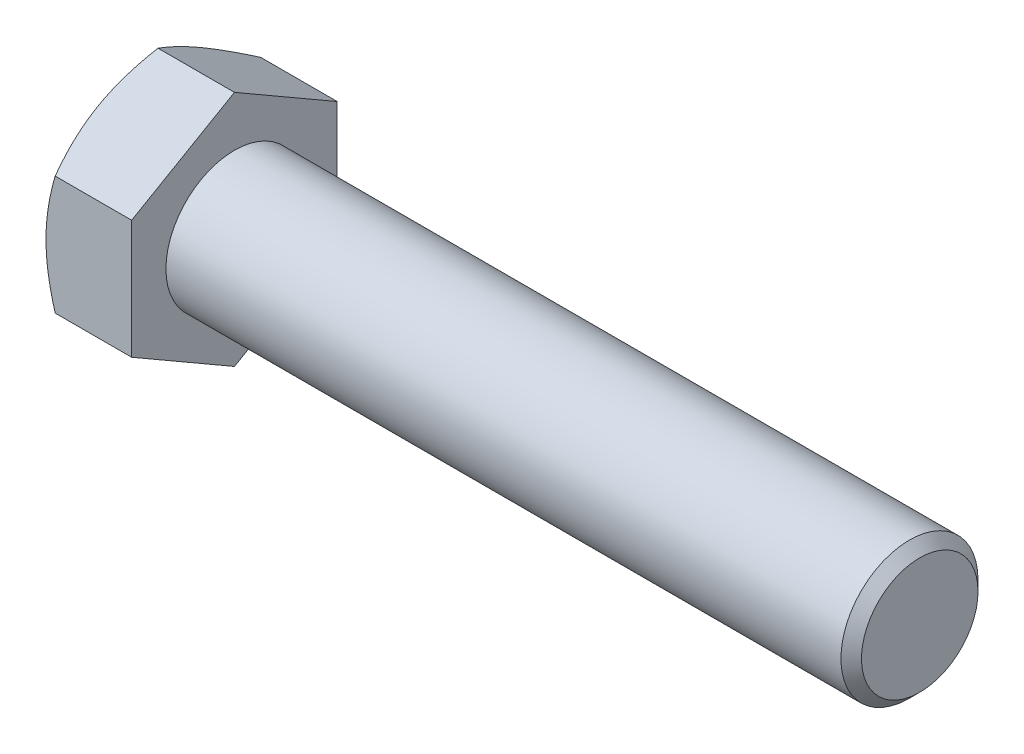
ISO-10303-21;
HEADER;
FILE_DESCRIPTION(('STEP AP214'),'2;1');
FILE_NAME('part.step','',(''),(''),'','','');
FILE_SCHEMA(('AUTOMOTIVE_DESIGN { 1 0 10303 214 1 1 1 1 }'));
ENDSEC;
DATA;
#1=APPLICATION_CONTEXT('core data for automotive mechanical design processes');
#2=APPLICATION_PROTOCOL_DEFINITION('international standard','automotive_design',2000,#1);
#3=PRODUCT_CONTEXT('',#1,'mechanical');
#4=PRODUCT('Part','Part','',(#3));
#5=PRODUCT_RELATED_PRODUCT_CATEGORY('part','',(#4));
#6=PRODUCT_DEFINITION_FORMATION('','',#4);
#7=PRODUCT_DEFINITION_CONTEXT('part definition',#1,'design');
#8=PRODUCT_DEFINITION('design','',#6,#7);
#9=PRODUCT_DEFINITION_SHAPE('','',#8);
#10=(LENGTH_UNIT() NAMED_UNIT(*) SI_UNIT(.MILLI.,.METRE.));
#11=(NAMED_UNIT(*) PLANE_ANGLE_UNIT() SI_UNIT($,.RADIAN.));
#12=(NAMED_UNIT(*) SI_UNIT($,.STERADIAN.) SOLID_ANGLE_UNIT());
#13=UNCERTAINTY_MEASURE_WITH_UNIT(LENGTH_MEASURE(1.E-05),#10,'distance_accuracy_value','');
#14=(GEOMETRIC_REPRESENTATION_CONTEXT(3) GLOBAL_UNCERTAINTY_ASSIGNED_CONTEXT((#13)) GLOBAL_UNIT_ASSIGNED_CONTEXT((#10,
#11,#12)) REPRESENTATION_CONTEXT('',''));
#15=CARTESIAN_POINT('',(0.,0.,0.));
#16=DIRECTION('',(0.,0.,1.));
#17=DIRECTION('',(1.,0.,0.));
#18=AXIS2_PLACEMENT_3D('',#15,#16,#17);
#19=CARTESIAN_POINT('',(-35.71875,-5.49926131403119,9.525));
#20=DIRECTION('',(0.,0.,-1.));
#21=DIRECTION('',(0.,1.,0.));
#22=AXIS2_PLACEMENT_3D('',#19,#20,#21);
#23=PLANE('',#22);
#24=CARTESIAN_POINT('',(-30.9486487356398,-15.0217774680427,9.525));
#25=CARTESIAN_POINT('',(-31.0506067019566,-14.8126684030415,9.525));
#26=CARTESIAN_POINT('',(-31.1520747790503,-14.6033205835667,9.525));
#27=CARTESIAN_POINT('',(-31.3539206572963,-14.1840977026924,9.525));
#28=CARTESIAN_POINT('',(-31.4542984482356,-13.9742226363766,9.525));
#29=CARTESIAN_POINT('',(-31.7536555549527,-13.343679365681,9.525));
#30=CARTESIAN_POINT('',(-31.9508301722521,-12.9221512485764,9.525));
#31=CARTESIAN_POINT('',(-32.3402292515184,-12.0741799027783,9.525));
#32=CARTESIAN_POINT('',(-32.5324230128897,-11.647722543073,9.525));
#33=CARTESIAN_POINT('',(-32.9092739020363,-10.7915024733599,9.525));
#34=CARTESIAN_POINT('',(-33.093931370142,-10.3617399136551,9.525));
#35=CARTESIAN_POINT('',(-33.4598459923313,-9.48353036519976,9.525));
#36=CARTESIAN_POINT('',(-33.6407734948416,-9.03494529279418,9.525));
#37=CARTESIAN_POINT('',(-33.9895311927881,-8.13262154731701,9.525));
#38=CARTESIAN_POINT('',(-34.1573599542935,-7.67888231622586,9.525));
#39=CARTESIAN_POINT('',(-34.4756966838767,-6.76629372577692,9.525));
#40=CARTESIAN_POINT('',(-34.6262376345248,-6.30745599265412,9.525));
#41=CARTESIAN_POINT('',(-34.9053361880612,-5.38321964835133,9.525));
#42=CARTESIAN_POINT('',(-35.0339004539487,-4.91782307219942,9.525));
#43=CARTESIAN_POINT('',(-35.262353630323,-3.98270790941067,9.525));
#44=CARTESIAN_POINT('',(-35.362403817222,-3.51302979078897,9.525));
#45=CARTESIAN_POINT('',(-35.4868823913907,-2.80404305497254,9.525));
#46=CARTESIAN_POINT('',(-35.5241106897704,-2.56695395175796,9.525));
#47=CARTESIAN_POINT('',(-35.5893117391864,-2.09151423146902,9.525));
#48=CARTESIAN_POINT('',(-35.6172853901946,-1.85316373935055,9.525));
#49=CARTESIAN_POINT('',(-35.6630553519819,-1.37874363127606,9.525));
#50=CARTESIAN_POINT('',(-35.6809844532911,-1.1426868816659,9.525));
#51=CARTESIAN_POINT('',(-35.706834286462,-0.670025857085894,9.525));
#52=CARTESIAN_POINT('',(-35.7147551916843,-0.43342159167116,9.525));
#53=CARTESIAN_POINT('',(-35.7203985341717,0.0399119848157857,9.525));
#54=CARTESIAN_POINT('',(-35.7181209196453,0.27664129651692,9.525));
#55=CARTESIAN_POINT('',(-35.7034255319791,0.749787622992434,9.525));
#56=CARTESIAN_POINT('',(-35.6910072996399,0.986204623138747,9.525));
#57=CARTESIAN_POINT('',(-35.6497999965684,1.54688913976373,9.525));
#58=CARTESIAN_POINT('',(-35.6166171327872,1.87084123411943,9.525));
#59=CARTESIAN_POINT('',(-35.5329658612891,2.51648812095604,9.525));
#60=CARTESIAN_POINT('',(-35.4824953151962,2.83818262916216,9.525));
#61=CARTESIAN_POINT('',(-35.3078165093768,3.79942022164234,9.525));
#62=CARTESIAN_POINT('',(-35.1603672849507,4.43480406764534,9.525));
#63=CARTESIAN_POINT('',(-34.9027542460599,5.38541546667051,9.525));
#64=CARTESIAN_POINT('',(-34.8095266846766,5.70551752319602,9.525));
#65=CARTESIAN_POINT('',(-34.6129126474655,6.34261721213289,9.525));
#66=CARTESIAN_POINT('',(-34.5095260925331,6.65961482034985,9.525));
#67=CARTESIAN_POINT('',(-34.2942921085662,7.29059996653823,9.525));
#68=CARTESIAN_POINT('',(-34.1824470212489,7.60458831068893,9.525));
#69=CARTESIAN_POINT('',(-33.9516593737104,8.22992853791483,9.525));
#70=CARTESIAN_POINT('',(-33.8327169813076,8.54128048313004,9.525));
#71=CARTESIAN_POINT('',(-33.5011473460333,9.38496234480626,9.525));
#72=CARTESIAN_POINT('',(-33.2827201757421,9.91501080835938,9.525));
#73=CARTESIAN_POINT('',(-32.8328761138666,10.9695875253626,9.525));
#74=CARTESIAN_POINT('',(-32.6014577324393,11.4941151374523,9.52499999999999));
#75=CARTESIAN_POINT('',(-32.1287302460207,12.5389296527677,9.52499999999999));
#76=CARTESIAN_POINT('',(-31.8874172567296,13.0592147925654,9.52499999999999));
#77=CARTESIAN_POINT('',(-31.39728685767,14.0961990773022,9.52499999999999));
#78=CARTESIAN_POINT('',(-31.1484697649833,14.6128983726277,9.52499999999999));
#79=CARTESIAN_POINT('',(-30.6445630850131,15.6442756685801,9.52499999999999));
#80=CARTESIAN_POINT('',(-30.3894638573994,16.1589489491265,9.52499999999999));
#81=CARTESIAN_POINT('',(-29.8746115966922,17.1859640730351,9.52499999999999));
#82=CARTESIAN_POINT('',(-29.614858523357,17.6983058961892,9.52499999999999));
#83=CARTESIAN_POINT('',(-29.091678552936,18.7209603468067,9.52499999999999));
#84=CARTESIAN_POINT('',(-28.8282525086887,19.2312734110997,9.52499999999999));
#85=CARTESIAN_POINT('',(-28.2983602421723,20.2503195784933,9.52499999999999));
#86=CARTESIAN_POINT('',(-28.0318940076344,20.7590526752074,9.52499999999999));
#87=CARTESIAN_POINT('',(-27.2861203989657,22.1744276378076,9.52499999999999));
#88=CARTESIAN_POINT('',(-26.8040895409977,23.0796341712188,9.52499999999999));
#89=CARTESIAN_POINT('',(-25.8342669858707,24.8870231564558,9.52499999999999));
#90=CARTESIAN_POINT('',(-25.3464749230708,25.7892054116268,9.52499999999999));
#91=CARTESIAN_POINT('',(-24.3682753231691,27.5881540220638,9.52499999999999));
#92=CARTESIAN_POINT('',(-23.8778824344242,28.4849283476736,9.52499999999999));
#93=CARTESIAN_POINT('',(-23.139862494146,29.8287064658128,9.52499999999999));
#94=CARTESIAN_POINT('',(-22.8934606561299,30.2763840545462,9.52499999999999));
#95=CARTESIAN_POINT('',(-22.3999311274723,31.171338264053,9.52499999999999));
#96=CARTESIAN_POINT('',(-22.1528034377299,31.6186148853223,9.52499999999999));
#97=CARTESIAN_POINT('',(-21.9053579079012,32.0657156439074,9.52499999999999));
#98=B_SPLINE_CURVE_WITH_KNOTS('',3,(#24,#25,#26,#27,#28,#29,#30,#31,#32,#33,#34,#35,#36,#37,#38,
#39,#40,#41,#42,#43,#44,#45,#46,#47,#48,#49,#50,#51,#52,#53,#54,#55,#56,#57,#58,#59,#60,#61,#62,
#63,#64,#65,#66,#67,#68,#69,#70,#71,#72,#73,#74,#75,#76,#77,#78,#79,#80,#81,#82,#83,#84,#85,#86,
#87,#88,#89,#90,#91,#92,#93,#94,#95,#96,#97),.UNSPECIFIED.,.F.,.F.,(4,2,2,2,2,2,2,2,2,2,2,2,2,2,
2,2,2,2,2,2,2,2,2,2,2,2,2,2,2,2,2,2,2,2,2,2,4),(0.,0.697923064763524,1.39585266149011,
2.79190605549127,4.19514467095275,5.59831984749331,7.04925368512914,8.50034613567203,
9.94862243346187,11.3964588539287,12.8359359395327,13.5557663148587,14.2755266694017,
14.9855324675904,15.6955259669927,16.405523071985,17.1155523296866,18.0919474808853,
19.0684634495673,21.0224343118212,22.0225488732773,23.0226712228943,24.022517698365,
25.0223405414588,26.7419511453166,28.4617593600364,30.1822493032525,31.9026666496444,
33.6259126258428,35.3491735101,37.0720407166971,38.7949148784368,41.8715321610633,
44.9483457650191,48.0146376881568,49.5476609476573,51.0806823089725),.UNSPECIFIED.);
#99=CARTESIAN_POINT('',(-34.8680113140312,-5.49926131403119,9.525));
#100=VERTEX_POINT('',#99);
#101=CARTESIAN_POINT('',(-35.71875,0.,9.525));
#102=VERTEX_POINT('',#101);
#103=EDGE_CURVE('E582',#100,#102,#98,.T.);
#104=ORIENTED_EDGE('',*,*,#103,.F.);
#105=DIRECTION('',(1.,0.,0.));
#106=VECTOR('',#105,1.);
#107=CARTESIAN_POINT('',(-35.71875,-5.49926131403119,9.525));
#108=LINE('',#107,#106);
#109=CARTESIAN_POINT('',(-27.78125,-5.49926131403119,9.525));
#110=VERTEX_POINT('',#109);
#111=EDGE_CURVE('E564',#100,#110,#108,.T.);
#112=ORIENTED_EDGE('',*,*,#111,.T.);
#113=DIRECTION('',(0.,1.,0.));
#114=VECTOR('',#113,1.);
#115=CARTESIAN_POINT('',(-27.78125,-5.49926131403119,9.525));
#116=LINE('',#115,#114);
#117=CARTESIAN_POINT('',(-27.78125,5.49926131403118,9.525));
#118=VERTEX_POINT('',#117);
#119=EDGE_CURVE('E580',#110,#118,#116,.T.);
#120=ORIENTED_EDGE('',*,*,#119,.T.);
#121=DIRECTION('',(1.,0.,0.));
#122=VECTOR('',#121,1.);
#123=CARTESIAN_POINT('',(-35.71875,5.49926131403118,9.525));
#124=LINE('',#123,#122);
#125=CARTESIAN_POINT('',(-34.8680113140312,5.49926131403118,9.525));
#126=VERTEX_POINT('',#125);
#127=EDGE_CURVE('E554',#126,#118,#124,.T.);
#128=ORIENTED_EDGE('',*,*,#127,.F.);
#129=EDGE_CURVE('E482',#102,#126,#98,.T.);
#130=ORIENTED_EDGE('',*,*,#129,.F.);
#131=EDGE_LOOP('',(#104,#112,#120,#128,#130));
#132=FACE_BOUND('',#131,.T.);
#133=ADVANCED_FACE('F33',(#132),#23,.F.);
#134=CARTESIAN_POINT('',(-35.71875,5.49926131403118,9.525));
#135=DIRECTION('',(0.,-0.866025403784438,-0.5));
#136=DIRECTION('',(0.,0.5,-0.866025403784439));
#137=AXIS2_PLACEMENT_3D('',#134,#135,#136);
#138=PLANE('',#137);
#139=CARTESIAN_POINT('',(-34.8679446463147,5.49914584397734,9.5252));
#140=CARTESIAN_POINT('',(-34.9377267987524,5.62003162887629,9.31581967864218));
#141=CARTESIAN_POINT('',(-35.0043417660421,5.74136813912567,9.10565867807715));
#142=CARTESIAN_POINT('',(-35.13035853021,5.98501418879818,8.68365134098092));
#143=CARTESIAN_POINT('',(-35.1897579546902,6.1073240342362,8.47180447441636));
#144=CARTESIAN_POINT('',(-35.3559833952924,6.47622435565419,7.83285037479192));
#145=CARTESIAN_POINT('',(-35.4505316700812,6.72427111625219,7.40322078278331));
#146=CARTESIAN_POINT('',(-35.5613983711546,7.09546173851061,6.76029976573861));
#147=CARTESIAN_POINT('',(-35.5929801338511,7.21749664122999,6.54892911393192));
#148=CARTESIAN_POINT('',(-35.6459407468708,7.46213146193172,6.12520917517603));
#149=CARTESIAN_POINT('',(-35.667319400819,7.58473139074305,5.91285986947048));
#150=CARTESIAN_POINT('',(-35.6993260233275,7.83013575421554,5.48780704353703));
#151=CARTESIAN_POINT('',(-35.7099667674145,7.95293977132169,5.27510424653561));
#152=CARTESIAN_POINT('',(-35.7202714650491,8.1986612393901,4.84950217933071));
#153=CARTESIAN_POINT('',(-35.7199357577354,8.32157868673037,4.6366029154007));
#154=CARTESIAN_POINT('',(-35.7090511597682,8.55137586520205,4.23858252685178));
#155=CARTESIAN_POINT('',(-35.6998300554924,8.658271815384,4.0534333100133));
#156=CARTESIAN_POINT('',(-35.6732651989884,8.87181370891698,3.68356790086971));
#157=CARTESIAN_POINT('',(-35.6559208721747,8.97845963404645,3.49885174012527));
#158=CARTESIAN_POINT('',(-35.5921131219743,9.29798418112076,2.94541899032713));
#159=CARTESIAN_POINT('',(-35.5338828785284,9.51029722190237,2.57768201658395));
#160=CARTESIAN_POINT('',(-35.3883067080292,9.93717543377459,1.83830726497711));
#161=CARTESIAN_POINT('',(-35.3003437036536,10.1516861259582,1.46676384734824));
#162=CARTESIAN_POINT('',(-35.100704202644,10.5775086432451,0.729217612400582));
#163=CARTESIAN_POINT('',(-34.9890745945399,10.7888259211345,0.363205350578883));
#164=CARTESIAN_POINT('',(-34.8679446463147,10.9986380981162,-0.000200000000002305));
#165=B_SPLINE_CURVE_WITH_KNOTS('',3,(#139,#140,#141,#142,#143,#144,#145,#146,#147,#148,#149,
#150,#151,#152,#153,#154,#155,#156,#157,#158,#159,#160,#161,#162,#163,#164),.UNSPECIFIED.,.F.,
.F.,(4,2,2,2,2,2,2,2,2,2,2,2,4),(0.,0.754861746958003,1.50997101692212,3.02340406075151,
3.76154608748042,4.49970232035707,5.23697928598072,5.97423347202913,6.61604550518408,
7.25790294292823,8.54252993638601,9.85564695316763,11.1661863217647),.UNSPECIFIED.);
#166=CARTESIAN_POINT('',(-35.71875,8.24889197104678,4.7625));
#167=VERTEX_POINT('',#166);
#168=EDGE_CURVE('E588',#126,#167,#165,.T.);
#169=ORIENTED_EDGE('',*,*,#168,.F.);
#170=ORIENTED_EDGE('',*,*,#127,.T.);
#171=DIRECTION('',(0.,0.5,-0.866025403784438));
#172=VECTOR('',#171,1.);
#173=CARTESIAN_POINT('',(-27.78125,5.49926131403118,9.525));
#174=LINE('',#173,#172);
#175=CARTESIAN_POINT('',(-27.78125,10.9985226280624,0.));
#176=VERTEX_POINT('',#175);
#177=EDGE_CURVE('E578',#118,#176,#174,.T.);
#178=ORIENTED_EDGE('',*,*,#177,.T.);
#179=DIRECTION('',(1.,0.,0.));
#180=VECTOR('',#179,1.);
#181=CARTESIAN_POINT('',(-35.71875,10.9985226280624,0.));
#182=LINE('',#181,#180);
#183=CARTESIAN_POINT('',(-34.8680113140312,10.9985226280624,0.));
#184=VERTEX_POINT('',#183);
#185=EDGE_CURVE('E556',#184,#176,#182,.T.);
#186=ORIENTED_EDGE('',*,*,#185,.F.);
#187=EDGE_CURVE('E508',#167,#184,#165,.T.);
#188=ORIENTED_EDGE('',*,*,#187,.F.);
#189=EDGE_LOOP('',(#169,#170,#178,#186,#188));
#190=FACE_BOUND('',#189,.T.);
#191=ADVANCED_FACE('F518',(#190),#138,.F.);
#192=CARTESIAN_POINT('',(-35.71875,10.9985226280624,0.));
#193=DIRECTION('',(0.,-0.866025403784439,0.5));
#194=DIRECTION('',(0.,-0.5,-0.866025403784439));
#195=AXIS2_PLACEMENT_3D('',#192,#193,#194);
#196=PLANE('',#195);
#197=CARTESIAN_POINT('',(-34.8679446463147,10.9986380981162,0.000199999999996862));
#198=CARTESIAN_POINT('',(-34.9377267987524,10.8777523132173,-0.209180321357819));
#199=CARTESIAN_POINT('',(-35.0043417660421,10.7564158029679,-0.419341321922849));
#200=CARTESIAN_POINT('',(-35.13035853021,10.5127697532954,-0.841348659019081));
#201=CARTESIAN_POINT('',(-35.1897579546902,10.3904599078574,-1.05319552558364));
#202=CARTESIAN_POINT('',(-35.3559833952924,10.0215595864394,-1.69214962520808));
#203=CARTESIAN_POINT('',(-35.4505316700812,9.77351282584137,-2.12177921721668));
#204=CARTESIAN_POINT('',(-35.5613983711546,9.40232220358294,-2.76470023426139));
#205=CARTESIAN_POINT('',(-35.592980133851,9.28028730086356,-2.97607088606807));
#206=CARTESIAN_POINT('',(-35.6459407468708,9.03565248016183,-3.39979082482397));
#207=CARTESIAN_POINT('',(-35.667319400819,8.91305255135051,-3.61214013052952));
#208=CARTESIAN_POINT('',(-35.6993260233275,8.66764818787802,-4.03719295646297));
#209=CARTESIAN_POINT('',(-35.7099667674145,8.54484417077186,-4.24989575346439));
#210=CARTESIAN_POINT('',(-35.7202714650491,8.29912270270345,-4.67549782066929));
#211=CARTESIAN_POINT('',(-35.7199357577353,8.17620525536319,-4.8883970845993));
#212=CARTESIAN_POINT('',(-35.7090511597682,7.94640807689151,-5.28641747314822));
#213=CARTESIAN_POINT('',(-35.6998300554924,7.83951212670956,-5.4715666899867));
#214=CARTESIAN_POINT('',(-35.6732651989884,7.62597023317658,-5.84143209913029));
#215=CARTESIAN_POINT('',(-35.6559208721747,7.51932430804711,-6.02614825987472));
#216=CARTESIAN_POINT('',(-35.5921131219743,7.1997997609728,-6.57958100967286));
#217=CARTESIAN_POINT('',(-35.5338828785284,6.98748672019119,-6.94731798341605));
#218=CARTESIAN_POINT('',(-35.3883067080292,6.56060850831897,-7.68669273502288));
#219=CARTESIAN_POINT('',(-35.3003437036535,6.34609781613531,-8.05823615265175));
#220=CARTESIAN_POINT('',(-35.100704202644,5.92027529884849,-8.79578238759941));
#221=CARTESIAN_POINT('',(-34.9890745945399,5.70895802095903,-9.16179464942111));
#222=CARTESIAN_POINT('',(-34.8679446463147,5.49914584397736,-9.52519999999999));
#223=B_SPLINE_CURVE_WITH_KNOTS('',3,(#197,#198,#199,#200,#201,#202,#203,#204,#205,#206,#207,
#208,#209,#210,#211,#212,#213,#214,#215,#216,#217,#218,#219,#220,#221,#222),.UNSPECIFIED.,.F.,
.F.,(4,2,2,2,2,2,2,2,2,2,2,2,4),(0.,0.754861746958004,1.50997101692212,3.02340406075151,
3.76154608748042,4.49970232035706,5.23697928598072,5.97423347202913,6.61604550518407,
7.25790294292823,8.542529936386,9.85564695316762,11.1661863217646),.UNSPECIFIED.);
#224=CARTESIAN_POINT('',(-35.71875,8.24889197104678,-4.7625));
#225=VERTEX_POINT('',#224);
#226=EDGE_CURVE('E506',#184,#225,#223,.T.);
#227=ORIENTED_EDGE('',*,*,#226,.F.);
#228=ORIENTED_EDGE('',*,*,#185,.T.);
#229=DIRECTION('',(0.,-0.5,-0.866025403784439));
#230=VECTOR('',#229,1.);
#231=CARTESIAN_POINT('',(-27.78125,10.9985226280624,0.));
#232=LINE('',#231,#230);
#233=CARTESIAN_POINT('',(-27.78125,5.49926131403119,-9.52499999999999));
#234=VERTEX_POINT('',#233);
#235=EDGE_CURVE('E575',#176,#234,#232,.T.);
#236=ORIENTED_EDGE('',*,*,#235,.T.);
#237=DIRECTION('',(1.,0.,0.));
#238=VECTOR('',#237,1.);
#239=CARTESIAN_POINT('',(-35.71875,5.49926131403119,-9.52499999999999));
#240=LINE('',#239,#238);
#241=CARTESIAN_POINT('',(-34.8680113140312,5.49926131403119,-9.52499999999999));
#242=VERTEX_POINT('',#241);
#243=EDGE_CURVE('E558',#242,#234,#240,.T.);
#244=ORIENTED_EDGE('',*,*,#243,.F.);
#245=EDGE_CURVE('E500',#225,#242,#223,.T.);
#246=ORIENTED_EDGE('',*,*,#245,.F.);
#247=EDGE_LOOP('',(#227,#228,#236,#244,#246));
#248=FACE_BOUND('',#247,.T.);
#249=ADVANCED_FACE('F514',(#248),#196,.F.);
#250=CARTESIAN_POINT('',(-35.71875,5.49926131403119,-9.52499999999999));
#251=DIRECTION('',(0.,0.,1.));
#252=DIRECTION('',(1.,0.,0.));
#253=AXIS2_PLACEMENT_3D('',#250,#251,#252);
#254=PLANE('',#253);
#255=CARTESIAN_POINT('',(-30.9486487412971,-15.0217774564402,-9.52499999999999));
#256=CARTESIAN_POINT('',(-31.0506067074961,-14.8126683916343,-9.52499999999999));
#257=CARTESIAN_POINT('',(-31.152074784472,-14.603320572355,-9.52499999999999));
#258=CARTESIAN_POINT('',(-31.3539206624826,-14.1840976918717,-9.52499999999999));
#259=CARTESIAN_POINT('',(-31.4542984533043,-13.9742226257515,-9.52499999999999));
#260=CARTESIAN_POINT('',(-31.7536555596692,-13.3436793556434,-9.52499999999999));
#261=CARTESIAN_POINT('',(-31.9508301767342,-12.922151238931,-9.52499999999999));
#262=CARTESIAN_POINT('',(-32.3402292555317,-12.0741798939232,-9.52499999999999));
#263=CARTESIAN_POINT('',(-32.5324230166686,-11.6477225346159,-9.52499999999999));
#264=CARTESIAN_POINT('',(-32.9092739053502,-10.7915024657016,-9.52499999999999));
#265=CARTESIAN_POINT('',(-33.0939313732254,-10.3617399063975,-9.52499999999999));
#266=CARTESIAN_POINT('',(-33.4598459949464,-9.48353035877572,-9.52499999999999));
#267=CARTESIAN_POINT('',(-33.6407734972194,-9.0349452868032,-9.52499999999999));
#268=CARTESIAN_POINT('',(-33.989531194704,-8.13262154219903,-9.52499999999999));
#269=CARTESIAN_POINT('',(-34.1573599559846,-7.67888231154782,-9.52499999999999));
#270=CARTESIAN_POINT('',(-34.4756966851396,-6.76629372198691,-9.52499999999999));
#271=CARTESIAN_POINT('',(-34.6262376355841,-6.30745598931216,-9.52499999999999));
#272=CARTESIAN_POINT('',(-34.9053361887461,-5.3832196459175,-9.52499999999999));
#273=CARTESIAN_POINT('',(-35.0339004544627,-4.91782307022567,-9.52499999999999));
#274=CARTESIAN_POINT('',(-35.2623536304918,-3.98270790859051,-9.52499999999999));
#275=CARTESIAN_POINT('',(-35.3624038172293,-3.51302979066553,-9.52499999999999));
#276=CARTESIAN_POINT('',(-35.4868823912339,-2.8040430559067,-9.52499999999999));
#277=CARTESIAN_POINT('',(-35.5241106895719,-2.56695395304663,-9.52499999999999));
#278=CARTESIAN_POINT('',(-35.5893117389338,-2.09151423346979,-9.52499999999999));
#279=CARTESIAN_POINT('',(-35.6172853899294,-1.85316374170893,-9.52499999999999));
#280=CARTESIAN_POINT('',(-35.6630553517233,-1.37874363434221,-9.52499999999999));
#281=CARTESIAN_POINT('',(-35.680984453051,-1.14268688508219,-9.52499999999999));
#282=CARTESIAN_POINT('',(-35.7068342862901,-0.670025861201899,-9.52499999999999));
#283=CARTESIAN_POINT('',(-35.714755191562,-0.433421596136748,-9.52499999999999));
#284=CARTESIAN_POINT('',(-35.7203985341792,0.0399119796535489,-9.52499999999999));
#285=CARTESIAN_POINT('',(-35.7181209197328,0.276641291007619,-9.52499999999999));
#286=CARTESIAN_POINT('',(-35.7034255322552,0.749787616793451,-9.52499999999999));
#287=CARTESIAN_POINT('',(-35.6910073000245,0.98620461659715,-9.52499999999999));
#288=CARTESIAN_POINT('',(-35.6497999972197,1.54688913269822,-9.52499999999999));
#289=CARTESIAN_POINT('',(-35.6166171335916,1.87084122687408,-9.52499999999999));
#290=CARTESIAN_POINT('',(-35.5329658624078,2.51648811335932,-9.52499999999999));
#291=CARTESIAN_POINT('',(-35.4824953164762,2.83818262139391,-9.52499999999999));
#292=CARTESIAN_POINT('',(-35.3078165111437,3.79942021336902,-9.52499999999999));
#293=CARTESIAN_POINT('',(-35.1603672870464,4.43480405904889,-9.52499999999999));
#294=CARTESIAN_POINT('',(-34.9027542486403,5.3854154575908,-9.52499999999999));
#295=CARTESIAN_POINT('',(-34.8095266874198,5.70551751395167,-9.52499999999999));
#296=CARTESIAN_POINT('',(-34.612912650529,6.34261720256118,-9.52499999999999));
#297=CARTESIAN_POINT('',(-34.5095260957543,6.65961481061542,-9.52499999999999));
#298=CARTESIAN_POINT('',(-34.2942921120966,7.29059995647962,-9.52499999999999));
#299=CARTESIAN_POINT('',(-34.1824470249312,7.60458830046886,-9.52499999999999));
#300=CARTESIAN_POINT('',(-33.9516593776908,8.22992852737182,-9.52499999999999));
#301=CARTESIAN_POINT('',(-33.8327169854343,8.54128047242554,-9.52499999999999));
#302=CARTESIAN_POINT('',(-33.5011473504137,9.38496233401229,-9.52499999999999));
#303=CARTESIAN_POINT('',(-33.2827201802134,9.91501079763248,-9.52499999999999));
#304=CARTESIAN_POINT('',(-32.832876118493,10.9695875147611,-9.52499999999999));
#305=CARTESIAN_POINT('',(-32.6014577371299,11.4941151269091,-9.52499999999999));
#306=CARTESIAN_POINT('',(-32.1287302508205,12.5389296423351,-9.52499999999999));
#307=CARTESIAN_POINT('',(-31.8874172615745,13.0592147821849,-9.52499999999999));
#308=CARTESIAN_POINT('',(-31.3972868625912,14.0961990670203,-9.52499999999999));
#309=CARTESIAN_POINT('',(-31.1484697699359,14.6128983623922,-9.52499999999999));
#310=CARTESIAN_POINT('',(-30.6445630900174,15.6442756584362,-9.52499999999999));
#311=CARTESIAN_POINT('',(-30.3894638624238,16.1589489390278,-9.52499999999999));
#312=CARTESIAN_POINT('',(-29.8746116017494,17.1859640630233,-9.52499999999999));
#313=CARTESIAN_POINT('',(-29.6148585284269,17.6983058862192,-9.52499999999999));
#314=CARTESIAN_POINT('',(-29.091678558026,18.7209603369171,-9.52499999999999));
#315=CARTESIAN_POINT('',(-28.8282525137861,19.2312734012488,-9.52499999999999));
#316=CARTESIAN_POINT('',(-28.2983602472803,20.2503195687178,-9.52499999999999));
#317=CARTESIAN_POINT('',(-28.0318940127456,20.7590526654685,-9.52499999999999));
#318=CARTESIAN_POINT('',(-27.2861204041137,22.1744276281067,-9.52499999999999));
#319=CARTESIAN_POINT('',(-26.8040895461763,23.0796341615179,-9.52499999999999));
#320=CARTESIAN_POINT('',(-25.8342669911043,24.887023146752,-9.52499999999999));
#321=CARTESIAN_POINT('',(-25.3464749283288,25.7892054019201,-9.52499999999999));
#322=CARTESIAN_POINT('',(-24.3682753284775,27.5881540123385,-9.52499999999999));
#323=CARTESIAN_POINT('',(-23.8778824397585,28.4849283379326,-9.52499999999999));
#324=CARTESIAN_POINT('',(-23.1398624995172,29.8287064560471,-9.52499999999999));
#325=CARTESIAN_POINT('',(-22.8934606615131,30.2763840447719,-9.52499999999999));
#326=CARTESIAN_POINT('',(-22.3999311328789,31.1713382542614,-9.52499999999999));
#327=CARTESIAN_POINT('',(-22.1528034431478,31.6186148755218,-9.52499999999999));
#328=CARTESIAN_POINT('',(-21.9053579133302,32.0657156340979,-9.52499999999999));
#329=B_SPLINE_CURVE_WITH_KNOTS('',3,(#255,#256,#257,#258,#259,#260,#261,#262,#263,#264,#265,
#266,#267,#268,#269,#270,#271,#272,#273,#274,#275,#276,#277,#278,#279,#280,#281,#282,#283,#284,
#285,#286,#287,#288,#289,#290,#291,#292,#293,#294,#295,#296,#297,#298,#299,#300,#301,#302,#303,
#304,#305,#306,#307,#308,#309,#310,#311,#312,#313,#314,#315,#316,#317,#318,#319,#320,#321,#322,
#323,#324,#325,#326,#327,#328),.UNSPECIFIED.,.F.,.F.,(4,2,2,2,2,2,2,2,2,2,2,2,2,2,2,2,2,2,2,2,2,
2,2,2,2,2,2,2,2,2,2,2,2,2,2,2,4),(0.,0.697923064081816,1.3958526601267,2.79190605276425,
4.19514466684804,5.59831984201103,7.04925367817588,8.50034612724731,9.94862242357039,
11.3964588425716,12.8359359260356,13.5557663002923,14.2755266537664,14.9855324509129,
15.6955259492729,16.4055230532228,17.1155523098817,18.0919474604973,19.068463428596,
21.0224342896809,22.0225488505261,23.0226711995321,24.0225176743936,25.022340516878,
26.7419511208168,28.4617593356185,30.1822492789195,31.9026666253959,33.6259126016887,
35.3491734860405,37.0720406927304,38.794914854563,41.8715321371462,44.9483457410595,
48.0146376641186,49.5476609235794,51.0806822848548),.UNSPECIFIED.);
#330=CARTESIAN_POINT('',(-35.71875,0.,-9.525));
#331=VERTEX_POINT('',#330);
#332=EDGE_CURVE('E507',#242,#331,#329,.F.);
#333=ORIENTED_EDGE('',*,*,#332,.F.);
#334=ORIENTED_EDGE('',*,*,#243,.T.);
#335=DIRECTION('',(0.,-1.,0.));
#336=VECTOR('',#335,1.);
#337=CARTESIAN_POINT('',(-27.78125,5.49926131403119,-9.52499999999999));
#338=LINE('',#337,#336);
#339=CARTESIAN_POINT('',(-27.78125,-5.49926131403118,-9.52499999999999));
#340=VERTEX_POINT('',#339);
#341=EDGE_CURVE('E572',#234,#340,#338,.T.);
#342=ORIENTED_EDGE('',*,*,#341,.T.);
#343=DIRECTION('',(1.,0.,0.));
#344=VECTOR('',#343,1.);
#345=CARTESIAN_POINT('',(-35.71875,-5.49926131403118,-9.52499999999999));
#346=LINE('',#345,#344);
#347=CARTESIAN_POINT('',(-34.8680113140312,-5.49926131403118,-9.52499999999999));
#348=VERTEX_POINT('',#347);
#349=EDGE_CURVE('E560',#348,#340,#346,.T.);
#350=ORIENTED_EDGE('',*,*,#349,.F.);
#351=EDGE_CURVE('E493',#331,#348,#329,.F.);
#352=ORIENTED_EDGE('',*,*,#351,.F.);
#353=EDGE_LOOP('',(#333,#334,#342,#350,#352));
#354=FACE_BOUND('',#353,.T.);
#355=ADVANCED_FACE('F517',(#354),#254,.F.);
#356=CARTESIAN_POINT('',(-35.71875,-5.49926131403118,-9.52499999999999));
#357=DIRECTION('',(0.,0.866025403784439,0.5));
#358=DIRECTION('',(0.,-0.5,0.866025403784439));
#359=AXIS2_PLACEMENT_3D('',#356,#357,#358);
#360=PLANE('',#359);
#361=CARTESIAN_POINT('',(-34.8679446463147,-5.49914584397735,-9.52519999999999));
#362=CARTESIAN_POINT('',(-34.9377267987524,-5.62003162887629,-9.31581967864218));
#363=CARTESIAN_POINT('',(-35.0043417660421,-5.74136813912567,-9.10565867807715));
#364=CARTESIAN_POINT('',(-35.13035853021,-5.98501418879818,-8.68365134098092));
#365=CARTESIAN_POINT('',(-35.1897579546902,-6.10732403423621,-8.47180447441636));
#366=CARTESIAN_POINT('',(-35.3559833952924,-6.47622435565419,-7.83285037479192));
#367=CARTESIAN_POINT('',(-35.4505316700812,-6.72427111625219,-7.40322078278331));
#368=CARTESIAN_POINT('',(-35.5613983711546,-7.09546173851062,-6.76029976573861));
#369=CARTESIAN_POINT('',(-35.5929801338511,-7.21749664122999,-6.54892911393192));
#370=CARTESIAN_POINT('',(-35.6459407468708,-7.46213146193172,-6.12520917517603));
#371=CARTESIAN_POINT('',(-35.667319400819,-7.58473139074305,-5.91285986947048));
#372=CARTESIAN_POINT('',(-35.6993260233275,-7.83013575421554,-5.48780704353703));
#373=CARTESIAN_POINT('',(-35.7099667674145,-7.9529397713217,-5.2751042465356));
#374=CARTESIAN_POINT('',(-35.7202714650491,-8.1986612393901,-4.84950217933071));
#375=CARTESIAN_POINT('',(-35.7199357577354,-8.32157868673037,-4.6366029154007));
#376=CARTESIAN_POINT('',(-35.7090511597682,-8.55137586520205,-4.23858252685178));
#377=CARTESIAN_POINT('',(-35.6998300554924,-8.658271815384,-4.0534333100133));
#378=CARTESIAN_POINT('',(-35.6732651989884,-8.87181370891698,-3.6835679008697));
#379=CARTESIAN_POINT('',(-35.6559208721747,-8.97845963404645,-3.49885174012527));
#380=CARTESIAN_POINT('',(-35.5921131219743,-9.29798418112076,-2.94541899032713));
#381=CARTESIAN_POINT('',(-35.5338828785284,-9.51029722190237,-2.57768201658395));
#382=CARTESIAN_POINT('',(-35.3883067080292,-9.93717543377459,-1.83830726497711));
#383=CARTESIAN_POINT('',(-35.3003437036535,-10.1516861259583,-1.46676384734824));
#384=CARTESIAN_POINT('',(-35.100704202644,-10.5775086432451,-0.729217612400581));
#385=CARTESIAN_POINT('',(-34.9890745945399,-10.7888259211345,-0.363205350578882));
#386=CARTESIAN_POINT('',(-34.8679446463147,-10.9986380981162,0.000200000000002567));
#387=B_SPLINE_CURVE_WITH_KNOTS('',3,(#361,#362,#363,#364,#365,#366,#367,#368,#369,#370,#371,
#372,#373,#374,#375,#376,#377,#378,#379,#380,#381,#382,#383,#384,#385,#386),.UNSPECIFIED.,.F.,
.F.,(4,2,2,2,2,2,2,2,2,2,2,2,4),(0.,0.754861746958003,1.50997101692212,3.02340406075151,
3.76154608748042,4.49970232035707,5.23697928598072,5.97423347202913,6.61604550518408,
7.25790294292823,8.54252993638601,9.85564695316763,11.1661863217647),.UNSPECIFIED.);
#388=CARTESIAN_POINT('',(-35.71875,-8.24889197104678,-4.7625));
#389=VERTEX_POINT('',#388);
#390=EDGE_CURVE('E615',#348,#389,#387,.T.);
#391=ORIENTED_EDGE('',*,*,#390,.F.);
#392=ORIENTED_EDGE('',*,*,#349,.T.);
#393=DIRECTION('',(0.,-0.5,0.866025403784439));
#394=VECTOR('',#393,1.);
#395=CARTESIAN_POINT('',(-27.78125,-5.49926131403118,-9.52499999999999));
#396=LINE('',#395,#394);
#397=CARTESIAN_POINT('',(-27.78125,-10.9985226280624,0.));
#398=VERTEX_POINT('',#397);
#399=EDGE_CURVE('E569',#340,#398,#396,.T.);
#400=ORIENTED_EDGE('',*,*,#399,.T.);
#401=DIRECTION('',(1.,0.,0.));
#402=VECTOR('',#401,1.);
#403=CARTESIAN_POINT('',(-35.71875,-10.9985226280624,0.));
#404=LINE('',#403,#402);
#405=CARTESIAN_POINT('',(-34.8680113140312,-10.9985226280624,0.));
#406=VERTEX_POINT('',#405);
#407=EDGE_CURVE('E562',#406,#398,#404,.T.);
#408=ORIENTED_EDGE('',*,*,#407,.F.);
#409=EDGE_CURVE('E457',#389,#406,#387,.T.);
#410=ORIENTED_EDGE('',*,*,#409,.F.);
#411=EDGE_LOOP('',(#391,#392,#400,#408,#410));
#412=FACE_BOUND('',#411,.T.);
#413=ADVANCED_FACE('F537',(#412),#360,.F.);
#414=CARTESIAN_POINT('',(-35.71875,-10.9985226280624,0.));
#415=DIRECTION('',(0.,0.866025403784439,-0.5));
#416=DIRECTION('',(0.,0.5,0.866025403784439));
#417=AXIS2_PLACEMENT_3D('',#414,#415,#416);
#418=PLANE('',#417);
#419=CARTESIAN_POINT('',(-34.8679446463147,-10.9986380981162,-0.000199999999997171));
#420=CARTESIAN_POINT('',(-34.9377267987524,-10.8777523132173,0.209180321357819));
#421=CARTESIAN_POINT('',(-35.0043417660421,-10.7564158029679,0.41934132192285));
#422=CARTESIAN_POINT('',(-35.13035853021,-10.5127697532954,0.841348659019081));
#423=CARTESIAN_POINT('',(-35.1897579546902,-10.3904599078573,1.05319552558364));
#424=CARTESIAN_POINT('',(-35.3559833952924,-10.0215595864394,1.69214962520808));
#425=CARTESIAN_POINT('',(-35.4505316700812,-9.77351282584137,2.12177921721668));
#426=CARTESIAN_POINT('',(-35.5613983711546,-9.40232220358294,2.76470023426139));
#427=CARTESIAN_POINT('',(-35.592980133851,-9.28028730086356,2.97607088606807));
#428=CARTESIAN_POINT('',(-35.6459407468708,-9.03565248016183,3.39979082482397));
#429=CARTESIAN_POINT('',(-35.667319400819,-8.9130525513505,3.61214013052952));
#430=CARTESIAN_POINT('',(-35.6993260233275,-8.66764818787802,4.03719295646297));
#431=CARTESIAN_POINT('',(-35.7099667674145,-8.54484417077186,4.24989575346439));
#432=CARTESIAN_POINT('',(-35.7202714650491,-8.29912270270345,4.67549782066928));
#433=CARTESIAN_POINT('',(-35.7199357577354,-8.17620525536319,4.8883970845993));
#434=CARTESIAN_POINT('',(-35.7090511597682,-7.94640807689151,5.28641747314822));
#435=CARTESIAN_POINT('',(-35.6998300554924,-7.83951212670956,5.4715666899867));
#436=CARTESIAN_POINT('',(-35.6732651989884,-7.62597023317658,5.84143209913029));
#437=CARTESIAN_POINT('',(-35.6559208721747,-7.5193243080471,6.02614825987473));
#438=CARTESIAN_POINT('',(-35.5921131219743,-7.19979976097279,6.57958100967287));
#439=CARTESIAN_POINT('',(-35.5338828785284,-6.98748672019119,6.94731798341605));
#440=CARTESIAN_POINT('',(-35.3883067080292,-6.56060850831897,7.68669273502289));
#441=CARTESIAN_POINT('',(-35.3003437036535,-6.34609781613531,8.05823615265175));
#442=CARTESIAN_POINT('',(-35.100704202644,-5.92027529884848,8.79578238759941));
#443=CARTESIAN_POINT('',(-34.9890745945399,-5.70895802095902,9.16179464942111));
#444=CARTESIAN_POINT('',(-34.8679446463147,-5.49914584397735,9.5252));
#445=B_SPLINE_CURVE_WITH_KNOTS('',3,(#419,#420,#421,#422,#423,#424,#425,#426,#427,#428,#429,
#430,#431,#432,#433,#434,#435,#436,#437,#438,#439,#440,#441,#442,#443,#444),.UNSPECIFIED.,.F.,
.F.,(4,2,2,2,2,2,2,2,2,2,2,2,4),(0.,0.754861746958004,1.50997101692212,3.02340406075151,
3.76154608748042,4.49970232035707,5.23697928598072,5.97423347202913,6.61604550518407,
7.25790294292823,8.54252993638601,9.85564695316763,11.1661863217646),.UNSPECIFIED.);
#446=CARTESIAN_POINT('',(-35.71875,-8.24889197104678,4.7625));
#447=VERTEX_POINT('',#446);
#448=EDGE_CURVE('E456',#406,#447,#445,.T.);
#449=ORIENTED_EDGE('',*,*,#448,.F.);
#450=ORIENTED_EDGE('',*,*,#407,.T.);
#451=DIRECTION('',(0.,0.5,0.866025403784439));
#452=VECTOR('',#451,1.);
#453=CARTESIAN_POINT('',(-27.78125,-10.9985226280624,0.));
#454=LINE('',#453,#452);
#455=EDGE_CURVE('E566',#398,#110,#454,.T.);
#456=ORIENTED_EDGE('',*,*,#455,.T.);
#457=ORIENTED_EDGE('',*,*,#111,.F.);
#458=EDGE_CURVE('E448',#447,#100,#445,.T.);
#459=ORIENTED_EDGE('',*,*,#458,.F.);
#460=EDGE_LOOP('',(#449,#450,#456,#457,#459));
#461=FACE_BOUND('',#460,.T.);
#462=ADVANCED_FACE('F464',(#461),#418,.F.);
#463=CARTESIAN_POINT('',(-27.78125,0.,0.));
#464=DIRECTION('',(1.,0.,0.));
#465=DIRECTION('',(0.,0.,-1.));
#466=AXIS2_PLACEMENT_3D('',#463,#464,#465);
#467=CYLINDRICAL_SURFACE('',#466,6.35);
#468=CARTESIAN_POINT('',(-27.78125,0.,0.));
#469=DIRECTION('',(-1.,0.,0.));
#470=DIRECTION('',(0.,0.,1.));
#471=AXIS2_PLACEMENT_3D('',#468,#469,#470);
#472=CIRCLE('',#471,6.35);
#473=CARTESIAN_POINT('',(-27.78125,0.,6.35));
#474=VERTEX_POINT('',#473);
#475=EDGE_CURVE('E542',#474,#474,#472,.F.);
#476=ORIENTED_EDGE('',*,*,#475,.T.);
#477=EDGE_LOOP('',(#476));
#478=FACE_BOUND('',#477,.T.);
#479=CARTESIAN_POINT('',(34.76625,0.,0.));
#480=DIRECTION('',(1.,0.,0.));
#481=DIRECTION('',(0.,0.,-1.));
#482=AXIS2_PLACEMENT_3D('',#479,#480,#481);
#483=CIRCLE('',#482,6.35);
#484=CARTESIAN_POINT('',(34.76625,0.,-6.35));
#485=VERTEX_POINT('',#484);
#486=EDGE_CURVE('E545',#485,#485,#483,.F.);
#487=ORIENTED_EDGE('',*,*,#486,.T.);
#488=EDGE_LOOP('',(#487));
#489=FACE_BOUND('',#488,.T.);
#490=ADVANCED_FACE('F530',(#478,#489),#467,.T.);
#491=CARTESIAN_POINT('',(35.71875,0.,0.));
#492=DIRECTION('',(1.,0.,0.));
#493=DIRECTION('',(0.,0.,-1.));
#494=AXIS2_PLACEMENT_3D('',#491,#492,#493);
#495=PLANE('',#494);
#496=CARTESIAN_POINT('',(35.71875,0.,0.));
#497=DIRECTION('',(1.,0.,0.));
#498=DIRECTION('',(0.,0.,-1.));
#499=AXIS2_PLACEMENT_3D('',#496,#497,#498);
#500=CIRCLE('',#499,5.39750000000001);
#501=CARTESIAN_POINT('',(35.71875,0.,-5.39750000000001));
#502=VERTEX_POINT('',#501);
#503=EDGE_CURVE('E547',#502,#502,#500,.T.);
#504=ORIENTED_EDGE('',*,*,#503,.T.);
#505=EDGE_LOOP('',(#504));
#506=FACE_BOUND('',#505,.T.);
#507=ADVANCED_FACE('F528',(#506),#495,.T.);
#508=CARTESIAN_POINT('',(35.71875,0.,0.));
#509=DIRECTION('',(-1.,0.,0.));
#510=DIRECTION('',(0.,0.,1.));
#511=AXIS2_PLACEMENT_3D('',#508,#509,#510);
#512=CONICAL_SURFACE('',#511,5.39750000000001,0.785398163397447);
#513=ORIENTED_EDGE('',*,*,#486,.F.);
#514=EDGE_LOOP('',(#513));
#515=FACE_BOUND('',#514,.T.);
#516=ORIENTED_EDGE('',*,*,#503,.F.);
#517=EDGE_LOOP('',(#516));
#518=FACE_BOUND('',#517,.T.);
#519=ADVANCED_FACE('F35',(#515,#518),#512,.T.);
#520=CARTESIAN_POINT('',(-27.78125,5.49926131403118,9.525));
#521=DIRECTION('',(-1.,0.,0.));
#522=DIRECTION('',(0.,0.,1.));
#523=AXIS2_PLACEMENT_3D('',#520,#521,#522);
#524=PLANE('',#523);
#525=ORIENTED_EDGE('',*,*,#475,.F.);
#526=EDGE_LOOP('',(#525));
#527=FACE_BOUND('',#526,.T.);
#528=ORIENTED_EDGE('',*,*,#119,.F.);
#529=ORIENTED_EDGE('',*,*,#455,.F.);
#530=ORIENTED_EDGE('',*,*,#399,.F.);
#531=ORIENTED_EDGE('',*,*,#341,.F.);
#532=ORIENTED_EDGE('',*,*,#235,.F.);
#533=ORIENTED_EDGE('',*,*,#177,.F.);
#534=EDGE_LOOP('',(#528,#529,#530,#531,#532,#533));
#535=FACE_BOUND('',#534,.T.);
#536=ADVANCED_FACE('F473',(#527,#535),#524,.F.);
#537=CARTESIAN_POINT('',(-35.71875,0.,0.));
#538=DIRECTION('',(1.,0.,0.));
#539=DIRECTION('',(0.,0.,1.));
#540=AXIS2_PLACEMENT_3D('',#537,#538,#539);
#541=CONICAL_SURFACE('',#540,9.525,1.0471975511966);
#542=ORIENTED_EDGE('',*,*,#103,.T.);
#543=CARTESIAN_POINT('',(-35.71875,0.,0.));
#544=DIRECTION('',(-1.,0.,0.));
#545=DIRECTION('',(0.,0.,1.));
#546=AXIS2_PLACEMENT_3D('',#543,#544,#545);
#547=CIRCLE('',#546,9.525);
#548=EDGE_CURVE('E37',#447,#102,#547,.T.);
#549=ORIENTED_EDGE('',*,*,#548,.F.);
#550=ORIENTED_EDGE('',*,*,#458,.T.);
#551=EDGE_LOOP('',(#542,#549,#550));
#552=FACE_BOUND('',#551,.T.);
#553=ADVANCED_FACE('F467',(#552),#541,.T.);
#554=ORIENTED_EDGE('',*,*,#409,.T.);
#555=ORIENTED_EDGE('',*,*,#448,.T.);
#556=EDGE_CURVE('E549',#389,#447,#547,.T.);
#557=ORIENTED_EDGE('',*,*,#556,.F.);
#558=EDGE_LOOP('',(#554,#555,#557));
#559=FACE_BOUND('',#558,.T.);
#560=ADVANCED_FACE('F472',(#559),#541,.T.);
#561=ORIENTED_EDGE('',*,*,#351,.T.);
#562=ORIENTED_EDGE('',*,*,#390,.T.);
#563=EDGE_CURVE('E608',#331,#389,#547,.T.);
#564=ORIENTED_EDGE('',*,*,#563,.F.);
#565=EDGE_LOOP('',(#561,#562,#564));
#566=FACE_BOUND('',#565,.T.);
#567=ADVANCED_FACE('F690',(#566),#541,.T.);
#568=ORIENTED_EDGE('',*,*,#245,.T.);
#569=ORIENTED_EDGE('',*,*,#332,.T.);
#570=EDGE_CURVE('E42',#225,#331,#547,.T.);
#571=ORIENTED_EDGE('',*,*,#570,.F.);
#572=EDGE_LOOP('',(#568,#569,#571));
#573=FACE_BOUND('',#572,.T.);
#574=ADVANCED_FACE('F602',(#573),#541,.T.);
#575=ORIENTED_EDGE('',*,*,#187,.T.);
#576=ORIENTED_EDGE('',*,*,#226,.T.);
#577=EDGE_CURVE('E12',#167,#225,#547,.T.);
#578=ORIENTED_EDGE('',*,*,#577,.F.);
#579=EDGE_LOOP('',(#575,#576,#578));
#580=FACE_BOUND('',#579,.T.);
#581=ADVANCED_FACE('F597',(#580),#541,.T.);
#582=ORIENTED_EDGE('',*,*,#129,.T.);
#583=ORIENTED_EDGE('',*,*,#168,.T.);
#584=CARTESIAN_POINT('',(-35.71875,0.,0.));
#585=DIRECTION('',(-1.,0.,0.));
#586=DIRECTION('',(0.,0.,1.));
#587=AXIS2_PLACEMENT_3D('',#584,#585,#586);
#588=CIRCLE('',#587,9.525);
#589=EDGE_CURVE('E439',#102,#167,#588,.T.);
#590=ORIENTED_EDGE('',*,*,#589,.F.);
#591=EDGE_LOOP('',(#582,#583,#590));
#592=FACE_BOUND('',#591,.T.);
#593=ADVANCED_FACE('F475',(#592),#541,.T.);
#594=CARTESIAN_POINT('',(-35.71875,5.49926131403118,9.525));
#595=DIRECTION('',(-1.,0.,0.));
#596=DIRECTION('',(0.,0.,1.));
#597=AXIS2_PLACEMENT_3D('',#594,#595,#596);
#598=PLANE('',#597);
#599=CARTESIAN_POINT('',(-35.71875,3.66712500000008,-6.35164681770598));
#600=DIRECTION('',(-1.,0.,0.));
#601=DIRECTION('',(0.,0.866025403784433,0.50000000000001));
#602=AXIS2_PLACEMENT_3D('',#599,#600,#601);
#603=CIRCLE('',#602,0.28575);
#604=CARTESIAN_POINT('',(-35.71875,3.91459175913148,-6.20877181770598));
#605=VERTEX_POINT('',#604);
#606=CARTESIAN_POINT('',(-35.71875,3.41965824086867,-6.49452181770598));
#607=VERTEX_POINT('',#606);
#608=EDGE_CURVE('E49',#605,#607,#603,.T.);
#609=ORIENTED_EDGE('',*,*,#608,.F.);
#610=DIRECTION('',(0.,0.50000000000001,-0.866025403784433));
#611=VECTOR('',#610,1.);
#612=CARTESIAN_POINT('',(-35.71875,3.91459175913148,-6.20877181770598));
#613=LINE('',#612,#611);
#614=CARTESIAN_POINT('',(-35.71875,2.29534175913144,-3.40414854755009));
#615=VERTEX_POINT('',#614);
#616=EDGE_CURVE('E269',#615,#605,#613,.T.);
#617=ORIENTED_EDGE('',*,*,#616,.F.);
#618=CARTESIAN_POINT('',(-35.71875,2.04787500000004,-3.54702354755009));
#619=DIRECTION('',(-1.,0.,0.));
#620=DIRECTION('',(0.,0.866025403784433,0.50000000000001));
#621=AXIS2_PLACEMENT_3D('',#618,#619,#620);
#622=CIRCLE('',#621,0.28575);
#623=CARTESIAN_POINT('',(-35.71875,1.80040824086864,-3.68989854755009));
#624=VERTEX_POINT('',#623);
#625=EDGE_CURVE('E272',#624,#615,#622,.T.);
#626=ORIENTED_EDGE('',*,*,#625,.F.);
#627=DIRECTION('',(0.,-0.50000000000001,0.866025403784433));
#628=VECTOR('',#627,1.);
#629=CARTESIAN_POINT('',(-35.71875,3.41965824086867,-6.49452181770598));
#630=LINE('',#629,#628);
#631=EDGE_CURVE('E278',#607,#624,#630,.T.);
#632=ORIENTED_EDGE('',*,*,#631,.F.);
#633=EDGE_LOOP('',(#609,#617,#626,#632));
#634=FACE_BOUND('',#633,.T.);
#635=CARTESIAN_POINT('',(-35.71875,-3.66712499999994,-6.35164681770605));
#636=DIRECTION('',(-1.,0.,0.));
#637=DIRECTION('',(0.,0.866025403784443,-0.499999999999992));
#638=AXIS2_PLACEMENT_3D('',#635,#636,#637);
#639=CIRCLE('',#638,0.28575);
#640=CARTESIAN_POINT('',(-35.71875,-3.41965824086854,-6.49452181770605));
#641=VERTEX_POINT('',#640);
#642=CARTESIAN_POINT('',(-35.71875,-3.91459175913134,-6.20877181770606));
#643=VERTEX_POINT('',#642);
#644=EDGE_CURVE('E57',#641,#643,#639,.T.);
#645=ORIENTED_EDGE('',*,*,#644,.F.);
#646=DIRECTION('',(0.,-0.499999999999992,-0.866025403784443));
#647=VECTOR('',#646,1.);
#648=CARTESIAN_POINT('',(-35.71875,-3.41965824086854,-6.49452181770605));
#649=LINE('',#648,#647);
#650=CARTESIAN_POINT('',(-35.71875,-1.80040824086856,-3.68989854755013));
#651=VERTEX_POINT('',#650);
#652=EDGE_CURVE('E291',#651,#641,#649,.T.);
#653=ORIENTED_EDGE('',*,*,#652,.F.);
#654=CARTESIAN_POINT('',(-35.71875,-2.04787499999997,-3.54702354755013));
#655=DIRECTION('',(-1.,0.,0.));
#656=DIRECTION('',(0.,0.866025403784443,-0.499999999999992));
#657=AXIS2_PLACEMENT_3D('',#654,#655,#656);
#658=CIRCLE('',#657,0.28575);
#659=CARTESIAN_POINT('',(-35.71875,-2.29534175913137,-3.40414854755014));
#660=VERTEX_POINT('',#659);
#661=EDGE_CURVE('E305',#660,#651,#658,.T.);
#662=ORIENTED_EDGE('',*,*,#661,.F.);
#663=DIRECTION('',(0.,0.499999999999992,0.866025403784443));
#664=VECTOR('',#663,1.);
#665=CARTESIAN_POINT('',(-35.71875,-3.91459175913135,-6.20877181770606));
#666=LINE('',#665,#664);
#667=EDGE_CURVE('E302',#643,#660,#666,.T.);
#668=ORIENTED_EDGE('',*,*,#667,.F.);
#669=EDGE_LOOP('',(#645,#653,#662,#668));
#670=FACE_BOUND('',#669,.T.);
#671=CARTESIAN_POINT('',(-35.71875,-7.33425,0.));
#672=DIRECTION('',(-1.,0.,0.));
#673=DIRECTION('',(0.,0.,-1.));
#674=AXIS2_PLACEMENT_3D('',#671,#672,#673);
#675=CIRCLE('',#674,0.28575);
#676=CARTESIAN_POINT('',(-35.71875,-7.33425,-0.28575));
#677=VERTEX_POINT('',#676);
#678=CARTESIAN_POINT('',(-35.71875,-7.33425,0.285749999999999));
#679=VERTEX_POINT('',#678);
#680=EDGE_CURVE('E312',#677,#679,#675,.T.);
#681=ORIENTED_EDGE('',*,*,#680,.F.);
#682=DIRECTION('',(0.,-1.,0.));
#683=VECTOR('',#682,1.);
#684=CARTESIAN_POINT('',(-35.71875,-7.33425,-0.28575));
#685=LINE('',#684,#683);
#686=CARTESIAN_POINT('',(-35.71875,-4.09575,-0.28575));
#687=VERTEX_POINT('',#686);
#688=EDGE_CURVE('E322',#687,#677,#685,.T.);
#689=ORIENTED_EDGE('',*,*,#688,.F.);
#690=CARTESIAN_POINT('',(-35.71875,-4.09575,0.));
#691=DIRECTION('',(-1.,0.,0.));
#692=DIRECTION('',(0.,0.,-1.));
#693=AXIS2_PLACEMENT_3D('',#690,#691,#692);
#694=CIRCLE('',#693,0.28575);
#695=CARTESIAN_POINT('',(-35.71875,-4.09575,0.285749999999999));
#696=VERTEX_POINT('',#695);
#697=EDGE_CURVE('E336',#696,#687,#694,.T.);
#698=ORIENTED_EDGE('',*,*,#697,.F.);
#699=DIRECTION('',(0.,1.,0.));
#700=VECTOR('',#699,1.);
#701=CARTESIAN_POINT('',(-35.71875,-7.33425,0.28575));
#702=LINE('',#701,#700);
#703=EDGE_CURVE('E333',#679,#696,#702,.T.);
#704=ORIENTED_EDGE('',*,*,#703,.F.);
#705=EDGE_LOOP('',(#681,#689,#698,#704));
#706=FACE_BOUND('',#705,.T.);
#707=CARTESIAN_POINT('',(-35.71875,-3.66712500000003,6.351646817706));
#708=DIRECTION('',(-1.,0.,0.));
#709=DIRECTION('',(0.,-0.866025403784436,-0.500000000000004));
#710=AXIS2_PLACEMENT_3D('',#707,#708,#709);
#711=CIRCLE('',#710,0.28575);
#712=CARTESIAN_POINT('',(-35.71875,-3.91459175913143,6.208771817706));
#713=VERTEX_POINT('',#712);
#714=CARTESIAN_POINT('',(-35.71875,-3.41965824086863,6.49452181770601));
#715=VERTEX_POINT('',#714);
#716=EDGE_CURVE('E343',#713,#715,#711,.T.);
#717=ORIENTED_EDGE('',*,*,#716,.F.);
#718=DIRECTION('',(0.,-0.500000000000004,0.866025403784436));
#719=VECTOR('',#718,1.);
#720=CARTESIAN_POINT('',(-35.71875,-3.91459175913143,6.208771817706));
#721=LINE('',#720,#719);
#722=CARTESIAN_POINT('',(-35.71875,-2.29534175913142,3.4041485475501));
#723=VERTEX_POINT('',#722);
#724=EDGE_CURVE('E354',#723,#713,#721,.T.);
#725=ORIENTED_EDGE('',*,*,#724,.F.);
#726=CARTESIAN_POINT('',(-35.71875,-2.04787500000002,3.54702354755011));
#727=DIRECTION('',(-1.,0.,0.));
#728=DIRECTION('',(0.,-0.866025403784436,-0.500000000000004));
#729=AXIS2_PLACEMENT_3D('',#726,#727,#728);
#730=CIRCLE('',#729,0.28575);
#731=CARTESIAN_POINT('',(-35.71875,-1.80040824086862,3.68989854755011));
#732=VERTEX_POINT('',#731);
#733=EDGE_CURVE('E368',#732,#723,#730,.T.);
#734=ORIENTED_EDGE('',*,*,#733,.F.);
#735=DIRECTION('',(0.,0.500000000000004,-0.866025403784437));
#736=VECTOR('',#735,1.);
#737=CARTESIAN_POINT('',(-35.71875,-3.41965824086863,6.49452181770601));
#738=LINE('',#737,#736);
#739=EDGE_CURVE('E365',#715,#732,#738,.T.);
#740=ORIENTED_EDGE('',*,*,#739,.F.);
#741=EDGE_LOOP('',(#717,#725,#734,#740));
#742=FACE_BOUND('',#741,.T.);
#743=CARTESIAN_POINT('',(-35.71875,3.66712499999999,6.35164681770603));
#744=DIRECTION('',(-1.,0.,0.));
#745=DIRECTION('',(0.,-0.86602540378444,0.499999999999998));
#746=AXIS2_PLACEMENT_3D('',#743,#744,#745);
#747=CIRCLE('',#746,0.28575);
#748=CARTESIAN_POINT('',(-35.71875,3.41965824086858,6.49452181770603));
#749=VERTEX_POINT('',#748);
#750=CARTESIAN_POINT('',(-35.71875,3.91459175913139,6.20877181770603));
#751=VERTEX_POINT('',#750);
#752=EDGE_CURVE('E375',#749,#751,#747,.T.);
#753=ORIENTED_EDGE('',*,*,#752,.F.);
#754=DIRECTION('',(0.,0.499999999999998,0.86602540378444));
#755=VECTOR('',#754,1.);
#756=CARTESIAN_POINT('',(-35.71875,3.41965824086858,6.49452181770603));
#757=LINE('',#756,#755);
#758=CARTESIAN_POINT('',(-35.71875,1.80040824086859,3.68989854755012));
#759=VERTEX_POINT('',#758);
#760=EDGE_CURVE('E386',#759,#749,#757,.T.);
#761=ORIENTED_EDGE('',*,*,#760,.F.);
#762=CARTESIAN_POINT('',(-35.71875,2.04787499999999,3.54702354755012));
#763=DIRECTION('',(-1.,0.,0.));
#764=DIRECTION('',(0.,-0.86602540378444,0.499999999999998));
#765=AXIS2_PLACEMENT_3D('',#762,#763,#764);
#766=CIRCLE('',#765,0.28575);
#767=CARTESIAN_POINT('',(-35.71875,2.2953417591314,3.40414854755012));
#768=VERTEX_POINT('',#767);
#769=EDGE_CURVE('E400',#768,#759,#766,.T.);
#770=ORIENTED_EDGE('',*,*,#769,.F.);
#771=DIRECTION('',(0.,-0.499999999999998,-0.86602540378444));
#772=VECTOR('',#771,1.);
#773=CARTESIAN_POINT('',(-35.71875,3.91459175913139,6.20877181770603));
#774=LINE('',#773,#772);
#775=EDGE_CURVE('E397',#751,#768,#774,.T.);
#776=ORIENTED_EDGE('',*,*,#775,.F.);
#777=EDGE_LOOP('',(#753,#761,#770,#776));
#778=FACE_BOUND('',#777,.T.);
#779=CARTESIAN_POINT('',(-35.71875,7.33425,0.));
#780=DIRECTION('',(-1.,0.,0.));
#781=DIRECTION('',(0.,0.,1.));
#782=AXIS2_PLACEMENT_3D('',#779,#780,#781);
#783=CIRCLE('',#782,0.28575);
#784=CARTESIAN_POINT('',(-35.71875,7.33425,0.28575));
#785=VERTEX_POINT('',#784);
#786=CARTESIAN_POINT('',(-35.71875,7.33425,-0.28575));
#787=VERTEX_POINT('',#786);
#788=EDGE_CURVE('E407',#785,#787,#783,.T.);
#789=ORIENTED_EDGE('',*,*,#788,.F.);
#790=DIRECTION('',(0.,1.,0.));
#791=VECTOR('',#790,1.);
#792=CARTESIAN_POINT('',(-35.71875,7.33425,0.28575));
#793=LINE('',#792,#791);
#794=CARTESIAN_POINT('',(-35.71875,4.09575,0.28575));
#795=VERTEX_POINT('',#794);
#796=EDGE_CURVE('E418',#795,#785,#793,.T.);
#797=ORIENTED_EDGE('',*,*,#796,.F.);
#798=CARTESIAN_POINT('',(-35.71875,4.09575,0.));
#799=DIRECTION('',(-1.,0.,0.));
#800=DIRECTION('',(0.,0.,1.));
#801=AXIS2_PLACEMENT_3D('',#798,#799,#800);
#802=CIRCLE('',#801,0.28575);
#803=CARTESIAN_POINT('',(-35.71875,4.09575,-0.285749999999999));
#804=VERTEX_POINT('',#803);
#805=EDGE_CURVE('E432',#804,#795,#802,.T.);
#806=ORIENTED_EDGE('',*,*,#805,.F.);
#807=DIRECTION('',(0.,-1.,0.));
#808=VECTOR('',#807,1.);
#809=CARTESIAN_POINT('',(-35.71875,7.33425,-0.28575));
#810=LINE('',#809,#808);
#811=EDGE_CURVE('E429',#787,#804,#810,.T.);
#812=ORIENTED_EDGE('',*,*,#811,.F.);
#813=EDGE_LOOP('',(#789,#797,#806,#812));
#814=FACE_BOUND('',#813,.T.);
#815=ORIENTED_EDGE('',*,*,#548,.T.);
#816=ORIENTED_EDGE('',*,*,#589,.T.);
#817=ORIENTED_EDGE('',*,*,#577,.T.);
#818=ORIENTED_EDGE('',*,*,#570,.T.);
#819=ORIENTED_EDGE('',*,*,#563,.T.);
#820=ORIENTED_EDGE('',*,*,#556,.T.);
#821=EDGE_LOOP('',(#815,#816,#817,#818,#819,#820));
#822=FACE_BOUND('',#821,.T.);
#823=ADVANCED_FACE('F478',(#634,#670,#706,#742,#778,#814,#822),#598,.T.);
#824=CARTESIAN_POINT('',(-35.46475,7.33425,0.));
#825=DIRECTION('',(-1.,0.,0.));
#826=DIRECTION('',(0.,0.,1.));
#827=AXIS2_PLACEMENT_3D('',#824,#825,#826);
#828=CYLINDRICAL_SURFACE('',#827,0.28575);
#829=ORIENTED_EDGE('',*,*,#788,.T.);
#830=DIRECTION('',(-1.,0.,0.));
#831=VECTOR('',#830,1.);
#832=CARTESIAN_POINT('',(-35.46475,7.33425,-0.28575));
#833=LINE('',#832,#831);
#834=CARTESIAN_POINT('',(-35.46475,7.33425,-0.28575));
#835=VERTEX_POINT('',#834);
#836=EDGE_CURVE('E427',#835,#787,#833,.T.);
#837=ORIENTED_EDGE('',*,*,#836,.F.);
#838=CARTESIAN_POINT('',(-35.46475,7.33425,0.));
#839=DIRECTION('',(-1.,0.,0.));
#840=DIRECTION('',(0.,0.,1.));
#841=AXIS2_PLACEMENT_3D('',#838,#839,#840);
#842=CIRCLE('',#841,0.28575);
#843=CARTESIAN_POINT('',(-35.46475,7.33425,0.28575));
#844=VERTEX_POINT('',#843);
#845=EDGE_CURVE('E414',#844,#835,#842,.T.);
#846=ORIENTED_EDGE('',*,*,#845,.F.);
#847=DIRECTION('',(-1.,0.,0.));
#848=VECTOR('',#847,1.);
#849=CARTESIAN_POINT('',(-35.46475,7.33425,0.28575));
#850=LINE('',#849,#848);
#851=EDGE_CURVE('E437',#844,#785,#850,.T.);
#852=ORIENTED_EDGE('',*,*,#851,.T.);
#853=EDGE_LOOP('',(#829,#837,#846,#852));
#854=FACE_BOUND('',#853,.T.);
#855=ADVANCED_FACE('F476',(#854),#828,.F.);
#856=CARTESIAN_POINT('',(-35.46475,7.33425,0.28575));
#857=DIRECTION('',(0.,0.,1.));
#858=DIRECTION('',(0.,-1.,0.));
#859=AXIS2_PLACEMENT_3D('',#856,#857,#858);
#860=PLANE('',#859);
#861=ORIENTED_EDGE('',*,*,#796,.T.);
#862=ORIENTED_EDGE('',*,*,#851,.F.);
#863=DIRECTION('',(0.,1.,0.));
#864=VECTOR('',#863,1.);
#865=CARTESIAN_POINT('',(-35.46475,7.33425,0.28575));
#866=LINE('',#865,#864);
#867=CARTESIAN_POINT('',(-35.46475,4.09575,0.28575));
#868=VERTEX_POINT('',#867);
#869=EDGE_CURVE('E424',#868,#844,#866,.T.);
#870=ORIENTED_EDGE('',*,*,#869,.F.);
#871=DIRECTION('',(-1.,0.,0.));
#872=VECTOR('',#871,1.);
#873=CARTESIAN_POINT('',(-35.46475,4.09575,0.28575));
#874=LINE('',#873,#872);
#875=EDGE_CURVE('E440',#868,#795,#874,.T.);
#876=ORIENTED_EDGE('',*,*,#875,.T.);
#877=EDGE_LOOP('',(#861,#862,#870,#876));
#878=FACE_BOUND('',#877,.T.);
#879=ADVANCED_FACE('F723',(#878),#860,.F.);
#880=CARTESIAN_POINT('',(-35.46475,4.09575,0.));
#881=DIRECTION('',(-1.,0.,0.));
#882=DIRECTION('',(0.,0.,1.));
#883=AXIS2_PLACEMENT_3D('',#880,#881,#882);
#884=CYLINDRICAL_SURFACE('',#883,0.28575);
#885=ORIENTED_EDGE('',*,*,#805,.T.);
#886=ORIENTED_EDGE('',*,*,#875,.F.);
#887=CARTESIAN_POINT('',(-35.46475,4.09575,0.));
#888=DIRECTION('',(-1.,0.,0.));
#889=DIRECTION('',(0.,0.,1.));
#890=AXIS2_PLACEMENT_3D('',#887,#888,#889);
#891=CIRCLE('',#890,0.28575);
#892=CARTESIAN_POINT('',(-35.46475,4.09575,-0.285749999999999));
#893=VERTEX_POINT('',#892);
#894=EDGE_CURVE('E421',#893,#868,#891,.T.);
#895=ORIENTED_EDGE('',*,*,#894,.F.);
#896=DIRECTION('',(-1.,0.,0.));
#897=VECTOR('',#896,1.);
#898=CARTESIAN_POINT('',(-35.46475,4.09575,-0.285749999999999));
#899=LINE('',#898,#897);
#900=EDGE_CURVE('E442',#893,#804,#899,.T.);
#901=ORIENTED_EDGE('',*,*,#900,.T.);
#902=EDGE_LOOP('',(#885,#886,#895,#901));
#903=FACE_BOUND('',#902,.T.);
#904=ADVANCED_FACE('F730',(#903),#884,.F.);
#905=CARTESIAN_POINT('',(-35.46475,7.33425,-0.28575));
#906=DIRECTION('',(0.,0.,-1.));
#907=DIRECTION('',(0.,1.,0.));
#908=AXIS2_PLACEMENT_3D('',#905,#906,#907);
#909=PLANE('',#908);
#910=ORIENTED_EDGE('',*,*,#811,.T.);
#911=ORIENTED_EDGE('',*,*,#900,.F.);
#912=DIRECTION('',(0.,-1.,0.));
#913=VECTOR('',#912,1.);
#914=CARTESIAN_POINT('',(-35.46475,7.33425,-0.28575));
#915=LINE('',#914,#913);
#916=EDGE_CURVE('E417',#835,#893,#915,.T.);
#917=ORIENTED_EDGE('',*,*,#916,.F.);
#918=ORIENTED_EDGE('',*,*,#836,.T.);
#919=EDGE_LOOP('',(#910,#911,#917,#918));
#920=FACE_BOUND('',#919,.T.);
#921=ADVANCED_FACE('F738',(#920),#909,.F.);
#922=CARTESIAN_POINT('',(-35.46475,7.33425,0.));
#923=DIRECTION('',(-1.,0.,0.));
#924=DIRECTION('',(0.,0.,1.));
#925=AXIS2_PLACEMENT_3D('',#922,#923,#924);
#926=PLANE('',#925);
#927=ORIENTED_EDGE('',*,*,#845,.T.);
#928=ORIENTED_EDGE('',*,*,#916,.T.);
#929=ORIENTED_EDGE('',*,*,#894,.T.);
#930=ORIENTED_EDGE('',*,*,#869,.T.);
#931=EDGE_LOOP('',(#927,#928,#929,#930));
#932=FACE_BOUND('',#931,.T.);
#933=ADVANCED_FACE('F746',(#932),#926,.T.);
#934=CARTESIAN_POINT('',(-35.46475,3.66712499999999,6.35164681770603));
#935=DIRECTION('',(-1.,0.,0.));
#936=DIRECTION('',(0.,0.,1.));
#937=AXIS2_PLACEMENT_3D('',#934,#935,#936);
#938=CYLINDRICAL_SURFACE('',#937,0.28575);
#939=ORIENTED_EDGE('',*,*,#752,.T.);
#940=DIRECTION('',(-1.,0.,0.));
#941=VECTOR('',#940,1.);
#942=CARTESIAN_POINT('',(-35.46475,3.91459175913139,6.20877181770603));
#943=LINE('',#942,#941);
#944=CARTESIAN_POINT('',(-35.46475,3.91459175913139,6.20877181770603));
#945=VERTEX_POINT('',#944);
#946=EDGE_CURVE('E395',#945,#751,#943,.T.);
#947=ORIENTED_EDGE('',*,*,#946,.F.);
#948=CARTESIAN_POINT('',(-35.46475,3.66712499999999,6.35164681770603));
#949=DIRECTION('',(-1.,0.,0.));
#950=DIRECTION('',(0.,-0.86602540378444,0.499999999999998));
#951=AXIS2_PLACEMENT_3D('',#948,#949,#950);
#952=CIRCLE('',#951,0.28575);
#953=CARTESIAN_POINT('',(-35.46475,3.41965824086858,6.49452181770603));
#954=VERTEX_POINT('',#953);
#955=EDGE_CURVE('E382',#954,#945,#952,.T.);
#956=ORIENTED_EDGE('',*,*,#955,.F.);
#957=DIRECTION('',(-1.,0.,0.));
#958=VECTOR('',#957,1.);
#959=CARTESIAN_POINT('',(-35.46475,3.41965824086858,6.49452181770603));
#960=LINE('',#959,#958);
#961=EDGE_CURVE('E405',#954,#749,#960,.T.);
#962=ORIENTED_EDGE('',*,*,#961,.T.);
#963=EDGE_LOOP('',(#939,#947,#956,#962));
#964=FACE_BOUND('',#963,.T.);
#965=ADVANCED_FACE('F752',(#964),#938,.F.);
#966=CARTESIAN_POINT('',(-35.46475,3.41965824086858,6.49452181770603));
#967=DIRECTION('',(0.,-0.86602540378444,0.499999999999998));
#968=DIRECTION('',(0.,-0.499999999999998,-0.86602540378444));
#969=AXIS2_PLACEMENT_3D('',#966,#967,#968);
#970=PLANE('',#969);
#971=ORIENTED_EDGE('',*,*,#760,.T.);
#972=ORIENTED_EDGE('',*,*,#961,.F.);
#973=DIRECTION('',(0.,0.499999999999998,0.86602540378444));
#974=VECTOR('',#973,1.);
#975=CARTESIAN_POINT('',(-35.46475,3.41965824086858,6.49452181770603));
#976=LINE('',#975,#974);
#977=CARTESIAN_POINT('',(-35.46475,1.80040824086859,3.68989854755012));
#978=VERTEX_POINT('',#977);
#979=EDGE_CURVE('E392',#978,#954,#976,.T.);
#980=ORIENTED_EDGE('',*,*,#979,.F.);
#981=DIRECTION('',(-1.,0.,0.));
#982=VECTOR('',#981,1.);
#983=CARTESIAN_POINT('',(-35.46475,1.80040824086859,3.68989854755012));
#984=LINE('',#983,#982);
#985=EDGE_CURVE('E408',#978,#759,#984,.T.);
#986=ORIENTED_EDGE('',*,*,#985,.T.);
#987=EDGE_LOOP('',(#971,#972,#980,#986));
#988=FACE_BOUND('',#987,.T.);
#989=ADVANCED_FACE('F759',(#988),#970,.F.);
#990=CARTESIAN_POINT('',(-35.46475,2.04787499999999,3.54702354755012));
#991=DIRECTION('',(-1.,0.,0.));
#992=DIRECTION('',(0.,0.,1.));
#993=AXIS2_PLACEMENT_3D('',#990,#991,#992);
#994=CYLINDRICAL_SURFACE('',#993,0.28575);
#995=ORIENTED_EDGE('',*,*,#769,.T.);
#996=ORIENTED_EDGE('',*,*,#985,.F.);
#997=CARTESIAN_POINT('',(-35.46475,2.04787499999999,3.54702354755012));
#998=DIRECTION('',(-1.,0.,0.));
#999=DIRECTION('',(0.,-0.86602540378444,0.499999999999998));
#1000=AXIS2_PLACEMENT_3D('',#997,#998,#999);
#1001=CIRCLE('',#1000,0.28575);
#1002=CARTESIAN_POINT('',(-35.46475,2.2953417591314,3.40414854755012));
#1003=VERTEX_POINT('',#1002);
#1004=EDGE_CURVE('E389',#1003,#978,#1001,.T.);
#1005=ORIENTED_EDGE('',*,*,#1004,.F.);
#1006=DIRECTION('',(-1.,0.,0.));
#1007=VECTOR('',#1006,1.);
#1008=CARTESIAN_POINT('',(-35.46475,2.2953417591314,3.40414854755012));
#1009=LINE('',#1008,#1007);
#1010=EDGE_CURVE('E410',#1003,#768,#1009,.T.);
#1011=ORIENTED_EDGE('',*,*,#1010,.T.);
#1012=EDGE_LOOP('',(#995,#996,#1005,#1011));
#1013=FACE_BOUND('',#1012,.T.);
#1014=ADVANCED_FACE('F767',(#1013),#994,.F.);
#1015=CARTESIAN_POINT('',(-35.46475,3.91459175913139,6.20877181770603));
#1016=DIRECTION('',(0.,0.86602540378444,-0.499999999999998));
#1017=DIRECTION('',(0.,0.499999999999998,0.86602540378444));
#1018=AXIS2_PLACEMENT_3D('',#1015,#1016,#1017);
#1019=PLANE('',#1018);
#1020=ORIENTED_EDGE('',*,*,#775,.T.);
#1021=ORIENTED_EDGE('',*,*,#1010,.F.);
#1022=DIRECTION('',(0.,-0.499999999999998,-0.86602540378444));
#1023=VECTOR('',#1022,1.);
#1024=CARTESIAN_POINT('',(-35.46475,3.91459175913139,6.20877181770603));
#1025=LINE('',#1024,#1023);
#1026=EDGE_CURVE('E385',#945,#1003,#1025,.T.);
#1027=ORIENTED_EDGE('',*,*,#1026,.F.);
#1028=ORIENTED_EDGE('',*,*,#946,.T.);
#1029=EDGE_LOOP('',(#1020,#1021,#1027,#1028));
#1030=FACE_BOUND('',#1029,.T.);
#1031=ADVANCED_FACE('F775',(#1030),#1019,.F.);
#1032=CARTESIAN_POINT('',(-35.46475,3.66712499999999,6.35164681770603));
#1033=DIRECTION('',(-1.,0.,0.));
#1034=DIRECTION('',(0.,-0.86602540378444,0.499999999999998));
#1035=AXIS2_PLACEMENT_3D('',#1032,#1033,#1034);
#1036=PLANE('',#1035);
#1037=ORIENTED_EDGE('',*,*,#955,.T.);
#1038=ORIENTED_EDGE('',*,*,#1026,.T.);
#1039=ORIENTED_EDGE('',*,*,#1004,.T.);
#1040=ORIENTED_EDGE('',*,*,#979,.T.);
#1041=EDGE_LOOP('',(#1037,#1038,#1039,#1040));
#1042=FACE_BOUND('',#1041,.T.);
#1043=ADVANCED_FACE('F783',(#1042),#1036,.T.);
#1044=CARTESIAN_POINT('',(-35.46475,-3.66712500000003,6.351646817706));
#1045=DIRECTION('',(-1.,0.,0.));
#1046=DIRECTION('',(0.,0.,1.));
#1047=AXIS2_PLACEMENT_3D('',#1044,#1045,#1046);
#1048=CYLINDRICAL_SURFACE('',#1047,0.28575);
#1049=ORIENTED_EDGE('',*,*,#716,.T.);
#1050=DIRECTION('',(-1.,0.,0.));
#1051=VECTOR('',#1050,1.);
#1052=CARTESIAN_POINT('',(-35.46475,-3.41965824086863,6.49452181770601));
#1053=LINE('',#1052,#1051);
#1054=CARTESIAN_POINT('',(-35.46475,-3.41965824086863,6.49452181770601));
#1055=VERTEX_POINT('',#1054);
#1056=EDGE_CURVE('E363',#1055,#715,#1053,.T.);
#1057=ORIENTED_EDGE('',*,*,#1056,.F.);
#1058=CARTESIAN_POINT('',(-35.46475,-3.66712500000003,6.351646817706));
#1059=DIRECTION('',(-1.,0.,0.));
#1060=DIRECTION('',(0.,-0.866025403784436,-0.500000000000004));
#1061=AXIS2_PLACEMENT_3D('',#1058,#1059,#1060);
#1062=CIRCLE('',#1061,0.28575);
#1063=CARTESIAN_POINT('',(-35.46475,-3.91459175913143,6.208771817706));
#1064=VERTEX_POINT('',#1063);
#1065=EDGE_CURVE('E350',#1064,#1055,#1062,.T.);
#1066=ORIENTED_EDGE('',*,*,#1065,.F.);
#1067=DIRECTION('',(-1.,0.,0.));
#1068=VECTOR('',#1067,1.);
#1069=CARTESIAN_POINT('',(-35.46475,-3.91459175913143,6.208771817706));
#1070=LINE('',#1069,#1068);
#1071=EDGE_CURVE('E373',#1064,#713,#1070,.T.);
#1072=ORIENTED_EDGE('',*,*,#1071,.T.);
#1073=EDGE_LOOP('',(#1049,#1057,#1066,#1072));
#1074=FACE_BOUND('',#1073,.T.);
#1075=ADVANCED_FACE('F791',(#1074),#1048,.F.);
#1076=CARTESIAN_POINT('',(-35.46475,-3.91459175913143,6.208771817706));
#1077=DIRECTION('',(0.,-0.866025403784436,-0.500000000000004));
#1078=DIRECTION('',(0.,0.500000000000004,-0.866025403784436));
#1079=AXIS2_PLACEMENT_3D('',#1076,#1077,#1078);
#1080=PLANE('',#1079);
#1081=ORIENTED_EDGE('',*,*,#724,.T.);
#1082=ORIENTED_EDGE('',*,*,#1071,.F.);
#1083=DIRECTION('',(0.,-0.500000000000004,0.866025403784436));
#1084=VECTOR('',#1083,1.);
#1085=CARTESIAN_POINT('',(-35.46475,-3.91459175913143,6.208771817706));
#1086=LINE('',#1085,#1084);
#1087=CARTESIAN_POINT('',(-35.46475,-2.29534175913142,3.4041485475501));
#1088=VERTEX_POINT('',#1087);
#1089=EDGE_CURVE('E360',#1088,#1064,#1086,.T.);
#1090=ORIENTED_EDGE('',*,*,#1089,.F.);
#1091=DIRECTION('',(-1.,0.,0.));
#1092=VECTOR('',#1091,1.);
#1093=CARTESIAN_POINT('',(-35.46475,-2.29534175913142,3.4041485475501));
#1094=LINE('',#1093,#1092);
#1095=EDGE_CURVE('E376',#1088,#723,#1094,.T.);
#1096=ORIENTED_EDGE('',*,*,#1095,.T.);
#1097=EDGE_LOOP('',(#1081,#1082,#1090,#1096));
#1098=FACE_BOUND('',#1097,.T.);
#1099=ADVANCED_FACE('F799',(#1098),#1080,.F.);
#1100=CARTESIAN_POINT('',(-35.46475,-2.04787500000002,3.54702354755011));
#1101=DIRECTION('',(-1.,0.,0.));
#1102=DIRECTION('',(0.,0.,1.));
#1103=AXIS2_PLACEMENT_3D('',#1100,#1101,#1102);
#1104=CYLINDRICAL_SURFACE('',#1103,0.28575);
#1105=ORIENTED_EDGE('',*,*,#733,.T.);
#1106=ORIENTED_EDGE('',*,*,#1095,.F.);
#1107=CARTESIAN_POINT('',(-35.46475,-2.04787500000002,3.54702354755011));
#1108=DIRECTION('',(-1.,0.,0.));
#1109=DIRECTION('',(0.,-0.866025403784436,-0.500000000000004));
#1110=AXIS2_PLACEMENT_3D('',#1107,#1108,#1109);
#1111=CIRCLE('',#1110,0.28575);
#1112=CARTESIAN_POINT('',(-35.46475,-1.80040824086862,3.68989854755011));
#1113=VERTEX_POINT('',#1112);
#1114=EDGE_CURVE('E357',#1113,#1088,#1111,.T.);
#1115=ORIENTED_EDGE('',*,*,#1114,.F.);
#1116=DIRECTION('',(-1.,0.,0.));
#1117=VECTOR('',#1116,1.);
#1118=CARTESIAN_POINT('',(-35.46475,-1.80040824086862,3.68989854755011));
#1119=LINE('',#1118,#1117);
#1120=EDGE_CURVE('E378',#1113,#732,#1119,.T.);
#1121=ORIENTED_EDGE('',*,*,#1120,.T.);
#1122=EDGE_LOOP('',(#1105,#1106,#1115,#1121));
#1123=FACE_BOUND('',#1122,.T.);
#1124=ADVANCED_FACE('F807',(#1123),#1104,.F.);
#1125=CARTESIAN_POINT('',(-35.46475,-3.41965824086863,6.49452181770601));
#1126=DIRECTION('',(0.,0.866025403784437,0.500000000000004));
#1127=DIRECTION('',(0.,-0.500000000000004,0.866025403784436));
#1128=AXIS2_PLACEMENT_3D('',#1125,#1126,#1127);
#1129=PLANE('',#1128);
#1130=ORIENTED_EDGE('',*,*,#739,.T.);
#1131=ORIENTED_EDGE('',*,*,#1120,.F.);
#1132=DIRECTION('',(0.,0.500000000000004,-0.866025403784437));
#1133=VECTOR('',#1132,1.);
#1134=CARTESIAN_POINT('',(-35.46475,-3.41965824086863,6.49452181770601));
#1135=LINE('',#1134,#1133);
#1136=EDGE_CURVE('E353',#1055,#1113,#1135,.T.);
#1137=ORIENTED_EDGE('',*,*,#1136,.F.);
#1138=ORIENTED_EDGE('',*,*,#1056,.T.);
#1139=EDGE_LOOP('',(#1130,#1131,#1137,#1138));
#1140=FACE_BOUND('',#1139,.T.);
#1141=ADVANCED_FACE('F815',(#1140),#1129,.F.);
#1142=CARTESIAN_POINT('',(-35.46475,-3.66712500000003,6.351646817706));
#1143=DIRECTION('',(-1.,0.,0.));
#1144=DIRECTION('',(0.,-0.866025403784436,-0.500000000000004));
#1145=AXIS2_PLACEMENT_3D('',#1142,#1143,#1144);
#1146=PLANE('',#1145);
#1147=ORIENTED_EDGE('',*,*,#1065,.T.);
#1148=ORIENTED_EDGE('',*,*,#1136,.T.);
#1149=ORIENTED_EDGE('',*,*,#1114,.T.);
#1150=ORIENTED_EDGE('',*,*,#1089,.T.);
#1151=EDGE_LOOP('',(#1147,#1148,#1149,#1150));
#1152=FACE_BOUND('',#1151,.T.);
#1153=ADVANCED_FACE('F823',(#1152),#1146,.T.);
#1154=CARTESIAN_POINT('',(-35.46475,-7.33425,0.));
#1155=DIRECTION('',(-1.,0.,0.));
#1156=DIRECTION('',(0.,0.,1.));
#1157=AXIS2_PLACEMENT_3D('',#1154,#1155,#1156);
#1158=CYLINDRICAL_SURFACE('',#1157,0.28575);
#1159=ORIENTED_EDGE('',*,*,#680,.T.);
#1160=DIRECTION('',(-1.,0.,0.));
#1161=VECTOR('',#1160,1.);
#1162=CARTESIAN_POINT('',(-35.46475,-7.33425,0.28575));
#1163=LINE('',#1162,#1161);
#1164=CARTESIAN_POINT('',(-35.46475,-7.33425,0.28575));
#1165=VERTEX_POINT('',#1164);
#1166=EDGE_CURVE('E331',#1165,#679,#1163,.T.);
#1167=ORIENTED_EDGE('',*,*,#1166,.F.);
#1168=CARTESIAN_POINT('',(-35.46475,-7.33425,0.));
#1169=DIRECTION('',(-1.,0.,0.));
#1170=DIRECTION('',(0.,0.,-1.));
#1171=AXIS2_PLACEMENT_3D('',#1168,#1169,#1170);
#1172=CIRCLE('',#1171,0.28575);
#1173=CARTESIAN_POINT('',(-35.46475,-7.33425,-0.28575));
#1174=VERTEX_POINT('',#1173);
#1175=EDGE_CURVE('E318',#1174,#1165,#1172,.T.);
#1176=ORIENTED_EDGE('',*,*,#1175,.F.);
#1177=DIRECTION('',(-1.,0.,0.));
#1178=VECTOR('',#1177,1.);
#1179=CARTESIAN_POINT('',(-35.46475,-7.33425,-0.28575));
#1180=LINE('',#1179,#1178);
#1181=EDGE_CURVE('E341',#1174,#677,#1180,.T.);
#1182=ORIENTED_EDGE('',*,*,#1181,.T.);
#1183=EDGE_LOOP('',(#1159,#1167,#1176,#1182));
#1184=FACE_BOUND('',#1183,.T.);
#1185=ADVANCED_FACE('F831',(#1184),#1158,.F.);
#1186=CARTESIAN_POINT('',(-35.46475,-7.33425,-0.28575));
#1187=DIRECTION('',(0.,0.,-1.));
#1188=DIRECTION('',(0.,1.,0.));
#1189=AXIS2_PLACEMENT_3D('',#1186,#1187,#1188);
#1190=PLANE('',#1189);
#1191=ORIENTED_EDGE('',*,*,#688,.T.);
#1192=ORIENTED_EDGE('',*,*,#1181,.F.);
#1193=DIRECTION('',(0.,-1.,0.));
#1194=VECTOR('',#1193,1.);
#1195=CARTESIAN_POINT('',(-35.46475,-7.33425,-0.28575));
#1196=LINE('',#1195,#1194);
#1197=CARTESIAN_POINT('',(-35.46475,-4.09575,-0.28575));
#1198=VERTEX_POINT('',#1197);
#1199=EDGE_CURVE('E328',#1198,#1174,#1196,.T.);
#1200=ORIENTED_EDGE('',*,*,#1199,.F.);
#1201=DIRECTION('',(-1.,0.,0.));
#1202=VECTOR('',#1201,1.);
#1203=CARTESIAN_POINT('',(-35.46475,-4.09575,-0.28575));
#1204=LINE('',#1203,#1202);
#1205=EDGE_CURVE('E344',#1198,#687,#1204,.T.);
#1206=ORIENTED_EDGE('',*,*,#1205,.T.);
#1207=EDGE_LOOP('',(#1191,#1192,#1200,#1206));
#1208=FACE_BOUND('',#1207,.T.);
#1209=ADVANCED_FACE('F839',(#1208),#1190,.F.);
#1210=CARTESIAN_POINT('',(-35.46475,-4.09575,0.));
#1211=DIRECTION('',(-1.,0.,0.));
#1212=DIRECTION('',(0.,0.,1.));
#1213=AXIS2_PLACEMENT_3D('',#1210,#1211,#1212);
#1214=CYLINDRICAL_SURFACE('',#1213,0.28575);
#1215=ORIENTED_EDGE('',*,*,#697,.T.);
#1216=ORIENTED_EDGE('',*,*,#1205,.F.);
#1217=CARTESIAN_POINT('',(-35.46475,-4.09575,0.));
#1218=DIRECTION('',(-1.,0.,0.));
#1219=DIRECTION('',(0.,0.,-1.));
#1220=AXIS2_PLACEMENT_3D('',#1217,#1218,#1219);
#1221=CIRCLE('',#1220,0.28575);
#1222=CARTESIAN_POINT('',(-35.46475,-4.09575,0.285749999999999));
#1223=VERTEX_POINT('',#1222);
#1224=EDGE_CURVE('E325',#1223,#1198,#1221,.T.);
#1225=ORIENTED_EDGE('',*,*,#1224,.F.);
#1226=DIRECTION('',(-1.,0.,0.));
#1227=VECTOR('',#1226,1.);
#1228=CARTESIAN_POINT('',(-35.46475,-4.09575,0.285749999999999));
#1229=LINE('',#1228,#1227);
#1230=EDGE_CURVE('E346',#1223,#696,#1229,.T.);
#1231=ORIENTED_EDGE('',*,*,#1230,.T.);
#1232=EDGE_LOOP('',(#1215,#1216,#1225,#1231));
#1233=FACE_BOUND('',#1232,.T.);
#1234=ADVANCED_FACE('F847',(#1233),#1214,.F.);
#1235=CARTESIAN_POINT('',(-35.46475,-7.33425,0.28575));
#1236=DIRECTION('',(0.,0.,1.));
#1237=DIRECTION('',(0.,-1.,0.));
#1238=AXIS2_PLACEMENT_3D('',#1235,#1236,#1237);
#1239=PLANE('',#1238);
#1240=ORIENTED_EDGE('',*,*,#703,.T.);
#1241=ORIENTED_EDGE('',*,*,#1230,.F.);
#1242=DIRECTION('',(0.,1.,0.));
#1243=VECTOR('',#1242,1.);
#1244=CARTESIAN_POINT('',(-35.46475,-7.33425,0.28575));
#1245=LINE('',#1244,#1243);
#1246=EDGE_CURVE('E321',#1165,#1223,#1245,.T.);
#1247=ORIENTED_EDGE('',*,*,#1246,.F.);
#1248=ORIENTED_EDGE('',*,*,#1166,.T.);
#1249=EDGE_LOOP('',(#1240,#1241,#1247,#1248));
#1250=FACE_BOUND('',#1249,.T.);
#1251=ADVANCED_FACE('F855',(#1250),#1239,.F.);
#1252=CARTESIAN_POINT('',(-35.46475,-7.33425,0.));
#1253=DIRECTION('',(-1.,0.,0.));
#1254=DIRECTION('',(0.,0.,-1.));
#1255=AXIS2_PLACEMENT_3D('',#1252,#1253,#1254);
#1256=PLANE('',#1255);
#1257=ORIENTED_EDGE('',*,*,#1175,.T.);
#1258=ORIENTED_EDGE('',*,*,#1246,.T.);
#1259=ORIENTED_EDGE('',*,*,#1224,.T.);
#1260=ORIENTED_EDGE('',*,*,#1199,.T.);
#1261=EDGE_LOOP('',(#1257,#1258,#1259,#1260));
#1262=FACE_BOUND('',#1261,.T.);
#1263=ADVANCED_FACE('F863',(#1262),#1256,.T.);
#1264=CARTESIAN_POINT('',(-35.46475,-3.66712499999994,-6.35164681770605));
#1265=DIRECTION('',(-1.,0.,0.));
#1266=DIRECTION('',(0.,0.,1.));
#1267=AXIS2_PLACEMENT_3D('',#1264,#1265,#1266);
#1268=CYLINDRICAL_SURFACE('',#1267,0.28575);
#1269=ORIENTED_EDGE('',*,*,#644,.T.);
#1270=DIRECTION('',(-1.,0.,0.));
#1271=VECTOR('',#1270,1.);
#1272=CARTESIAN_POINT('',(-35.46475,-3.91459175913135,-6.20877181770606));
#1273=LINE('',#1272,#1271);
#1274=CARTESIAN_POINT('',(-35.46475,-3.91459175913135,-6.20877181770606));
#1275=VERTEX_POINT('',#1274);
#1276=EDGE_CURVE('E300',#1275,#643,#1273,.T.);
#1277=ORIENTED_EDGE('',*,*,#1276,.F.);
#1278=CARTESIAN_POINT('',(-35.46475,-3.66712499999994,-6.35164681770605));
#1279=DIRECTION('',(-1.,0.,0.));
#1280=DIRECTION('',(0.,0.866025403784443,-0.499999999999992));
#1281=AXIS2_PLACEMENT_3D('',#1278,#1279,#1280);
#1282=CIRCLE('',#1281,0.28575);
#1283=CARTESIAN_POINT('',(-35.46475,-3.41965824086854,-6.49452181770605));
#1284=VERTEX_POINT('',#1283);
#1285=EDGE_CURVE('E287',#1284,#1275,#1282,.T.);
#1286=ORIENTED_EDGE('',*,*,#1285,.F.);
#1287=DIRECTION('',(-1.,0.,0.));
#1288=VECTOR('',#1287,1.);
#1289=CARTESIAN_POINT('',(-35.46475,-3.41965824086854,-6.49452181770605));
#1290=LINE('',#1289,#1288);
#1291=EDGE_CURVE('E310',#1284,#641,#1290,.T.);
#1292=ORIENTED_EDGE('',*,*,#1291,.T.);
#1293=EDGE_LOOP('',(#1269,#1277,#1286,#1292));
#1294=FACE_BOUND('',#1293,.T.);
#1295=ADVANCED_FACE('F871',(#1294),#1268,.F.);
#1296=CARTESIAN_POINT('',(-35.46475,-3.41965824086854,-6.49452181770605));
#1297=DIRECTION('',(0.,0.866025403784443,-0.499999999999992));
#1298=DIRECTION('',(0.,0.499999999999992,0.866025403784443));
#1299=AXIS2_PLACEMENT_3D('',#1296,#1297,#1298);
#1300=PLANE('',#1299);
#1301=ORIENTED_EDGE('',*,*,#652,.T.);
#1302=ORIENTED_EDGE('',*,*,#1291,.F.);
#1303=DIRECTION('',(0.,-0.499999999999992,-0.866025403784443));
#1304=VECTOR('',#1303,1.);
#1305=CARTESIAN_POINT('',(-35.46475,-3.41965824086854,-6.49452181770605));
#1306=LINE('',#1305,#1304);
#1307=CARTESIAN_POINT('',(-35.46475,-1.80040824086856,-3.68989854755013));
#1308=VERTEX_POINT('',#1307);
#1309=EDGE_CURVE('E297',#1308,#1284,#1306,.T.);
#1310=ORIENTED_EDGE('',*,*,#1309,.F.);
#1311=DIRECTION('',(-1.,0.,0.));
#1312=VECTOR('',#1311,1.);
#1313=CARTESIAN_POINT('',(-35.46475,-1.80040824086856,-3.68989854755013));
#1314=LINE('',#1313,#1312);
#1315=EDGE_CURVE('E313',#1308,#651,#1314,.T.);
#1316=ORIENTED_EDGE('',*,*,#1315,.T.);
#1317=EDGE_LOOP('',(#1301,#1302,#1310,#1316));
#1318=FACE_BOUND('',#1317,.T.);
#1319=ADVANCED_FACE('F879',(#1318),#1300,.F.);
#1320=CARTESIAN_POINT('',(-35.46475,-2.04787499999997,-3.54702354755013));
#1321=DIRECTION('',(-1.,0.,0.));
#1322=DIRECTION('',(0.,0.,1.));
#1323=AXIS2_PLACEMENT_3D('',#1320,#1321,#1322);
#1324=CYLINDRICAL_SURFACE('',#1323,0.28575);
#1325=ORIENTED_EDGE('',*,*,#661,.T.);
#1326=ORIENTED_EDGE('',*,*,#1315,.F.);
#1327=CARTESIAN_POINT('',(-35.46475,-2.04787499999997,-3.54702354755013));
#1328=DIRECTION('',(-1.,0.,0.));
#1329=DIRECTION('',(0.,0.866025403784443,-0.499999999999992));
#1330=AXIS2_PLACEMENT_3D('',#1327,#1328,#1329);
#1331=CIRCLE('',#1330,0.28575);
#1332=CARTESIAN_POINT('',(-35.46475,-2.29534175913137,-3.40414854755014));
#1333=VERTEX_POINT('',#1332);
#1334=EDGE_CURVE('E294',#1333,#1308,#1331,.T.);
#1335=ORIENTED_EDGE('',*,*,#1334,.F.);
#1336=DIRECTION('',(-1.,0.,0.));
#1337=VECTOR('',#1336,1.);
#1338=CARTESIAN_POINT('',(-35.46475,-2.29534175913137,-3.40414854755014));
#1339=LINE('',#1338,#1337);
#1340=EDGE_CURVE('E315',#1333,#660,#1339,.T.);
#1341=ORIENTED_EDGE('',*,*,#1340,.T.);
#1342=EDGE_LOOP('',(#1325,#1326,#1335,#1341));
#1343=FACE_BOUND('',#1342,.T.);
#1344=ADVANCED_FACE('F886',(#1343),#1324,.F.);
#1345=CARTESIAN_POINT('',(-35.46475,-3.91459175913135,-6.20877181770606));
#1346=DIRECTION('',(0.,-0.866025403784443,0.499999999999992));
#1347=DIRECTION('',(0.,-0.499999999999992,-0.866025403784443));
#1348=AXIS2_PLACEMENT_3D('',#1345,#1346,#1347);
#1349=PLANE('',#1348);
#1350=ORIENTED_EDGE('',*,*,#667,.T.);
#1351=ORIENTED_EDGE('',*,*,#1340,.F.);
#1352=DIRECTION('',(0.,0.499999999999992,0.866025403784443));
#1353=VECTOR('',#1352,1.);
#1354=CARTESIAN_POINT('',(-35.46475,-3.91459175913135,-6.20877181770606));
#1355=LINE('',#1354,#1353);
#1356=EDGE_CURVE('E290',#1275,#1333,#1355,.T.);
#1357=ORIENTED_EDGE('',*,*,#1356,.F.);
#1358=ORIENTED_EDGE('',*,*,#1276,.T.);
#1359=EDGE_LOOP('',(#1350,#1351,#1357,#1358));
#1360=FACE_BOUND('',#1359,.T.);
#1361=ADVANCED_FACE('F894',(#1360),#1349,.F.);
#1362=CARTESIAN_POINT('',(-35.46475,-3.66712499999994,-6.35164681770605));
#1363=DIRECTION('',(-1.,0.,0.));
#1364=DIRECTION('',(0.,0.866025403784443,-0.499999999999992));
#1365=AXIS2_PLACEMENT_3D('',#1362,#1363,#1364);
#1366=PLANE('',#1365);
#1367=ORIENTED_EDGE('',*,*,#1285,.T.);
#1368=ORIENTED_EDGE('',*,*,#1356,.T.);
#1369=ORIENTED_EDGE('',*,*,#1334,.T.);
#1370=ORIENTED_EDGE('',*,*,#1309,.T.);
#1371=EDGE_LOOP('',(#1367,#1368,#1369,#1370));
#1372=FACE_BOUND('',#1371,.T.);
#1373=ADVANCED_FACE('F902',(#1372),#1366,.T.);
#1374=CARTESIAN_POINT('',(-35.46475,3.66712500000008,-6.35164681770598));
#1375=DIRECTION('',(-1.,0.,0.));
#1376=DIRECTION('',(0.,0.,1.));
#1377=AXIS2_PLACEMENT_3D('',#1374,#1375,#1376);
#1378=CYLINDRICAL_SURFACE('',#1377,0.28575);
#1379=ORIENTED_EDGE('',*,*,#608,.T.);
#1380=DIRECTION('',(-1.,0.,0.));
#1381=VECTOR('',#1380,1.);
#1382=CARTESIAN_POINT('',(-35.46475,3.41965824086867,-6.49452181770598));
#1383=LINE('',#1382,#1381);
#1384=CARTESIAN_POINT('',(-35.46475,3.41965824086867,-6.49452181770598));
#1385=VERTEX_POINT('',#1384);
#1386=EDGE_CURVE('E247',#1385,#607,#1383,.T.);
#1387=ORIENTED_EDGE('',*,*,#1386,.F.);
#1388=CARTESIAN_POINT('',(-35.46475,3.66712500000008,-6.35164681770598));
#1389=DIRECTION('',(-1.,0.,0.));
#1390=DIRECTION('',(0.,0.866025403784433,0.50000000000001));
#1391=AXIS2_PLACEMENT_3D('',#1388,#1389,#1390);
#1392=CIRCLE('',#1391,0.28575);
#1393=CARTESIAN_POINT('',(-35.46475,3.91459175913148,-6.20877181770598));
#1394=VERTEX_POINT('',#1393);
#1395=EDGE_CURVE('E251',#1394,#1385,#1392,.T.);
#1396=ORIENTED_EDGE('',*,*,#1395,.F.);
#1397=DIRECTION('',(-1.,0.,0.));
#1398=VECTOR('',#1397,1.);
#1399=CARTESIAN_POINT('',(-35.46475,3.91459175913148,-6.20877181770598));
#1400=LINE('',#1399,#1398);
#1401=EDGE_CURVE('E282',#1394,#605,#1400,.T.);
#1402=ORIENTED_EDGE('',*,*,#1401,.T.);
#1403=EDGE_LOOP('',(#1379,#1387,#1396,#1402));
#1404=FACE_BOUND('',#1403,.T.);
#1405=ADVANCED_FACE('F249',(#1404),#1378,.F.);
#1406=CARTESIAN_POINT('',(-35.46475,3.91459175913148,-6.20877181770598));
#1407=DIRECTION('',(0.,0.866025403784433,0.50000000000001));
#1408=DIRECTION('',(0.,-0.50000000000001,0.866025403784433));
#1409=AXIS2_PLACEMENT_3D('',#1406,#1407,#1408);
#1410=PLANE('',#1409);
#1411=ORIENTED_EDGE('',*,*,#616,.T.);
#1412=ORIENTED_EDGE('',*,*,#1401,.F.);
#1413=DIRECTION('',(0.,0.50000000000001,-0.866025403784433));
#1414=VECTOR('',#1413,1.);
#1415=CARTESIAN_POINT('',(-35.46475,3.91459175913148,-6.20877181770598));
#1416=LINE('',#1415,#1414);
#1417=CARTESIAN_POINT('',(-35.46475,2.29534175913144,-3.40414854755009));
#1418=VERTEX_POINT('',#1417);
#1419=EDGE_CURVE('E257',#1418,#1394,#1416,.T.);
#1420=ORIENTED_EDGE('',*,*,#1419,.F.);
#1421=DIRECTION('',(-1.,0.,0.));
#1422=VECTOR('',#1421,1.);
#1423=CARTESIAN_POINT('',(-35.46475,2.29534175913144,-3.40414854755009));
#1424=LINE('',#1423,#1422);
#1425=EDGE_CURVE('E284',#1418,#615,#1424,.T.);
#1426=ORIENTED_EDGE('',*,*,#1425,.T.);
#1427=EDGE_LOOP('',(#1411,#1412,#1420,#1426));
#1428=FACE_BOUND('',#1427,.T.);
#1429=ADVANCED_FACE('F917',(#1428),#1410,.F.);
#1430=CARTESIAN_POINT('',(-35.46475,2.04787500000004,-3.54702354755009));
#1431=DIRECTION('',(-1.,0.,0.));
#1432=DIRECTION('',(0.,0.,1.));
#1433=AXIS2_PLACEMENT_3D('',#1430,#1431,#1432);
#1434=CYLINDRICAL_SURFACE('',#1433,0.28575);
#1435=ORIENTED_EDGE('',*,*,#625,.T.);
#1436=ORIENTED_EDGE('',*,*,#1425,.F.);
#1437=CARTESIAN_POINT('',(-35.46475,2.04787500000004,-3.54702354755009));
#1438=DIRECTION('',(-1.,0.,0.));
#1439=DIRECTION('',(0.,0.866025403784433,0.50000000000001));
#1440=AXIS2_PLACEMENT_3D('',#1437,#1438,#1439);
#1441=CIRCLE('',#1440,0.28575);
#1442=CARTESIAN_POINT('',(-35.46475,1.80040824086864,-3.68989854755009));
#1443=VERTEX_POINT('',#1442);
#1444=EDGE_CURVE('E265',#1443,#1418,#1441,.T.);
#1445=ORIENTED_EDGE('',*,*,#1444,.F.);
#1446=DIRECTION('',(-1.,0.,0.));
#1447=VECTOR('',#1446,1.);
#1448=CARTESIAN_POINT('',(-35.46475,1.80040824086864,-3.68989854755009));
#1449=LINE('',#1448,#1447);
#1450=EDGE_CURVE('E256',#1443,#624,#1449,.T.);
#1451=ORIENTED_EDGE('',*,*,#1450,.T.);
#1452=EDGE_LOOP('',(#1435,#1436,#1445,#1451));
#1453=FACE_BOUND('',#1452,.T.);
#1454=ADVANCED_FACE('F924',(#1453),#1434,.F.);
#1455=CARTESIAN_POINT('',(-35.46475,3.41965824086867,-6.49452181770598));
#1456=DIRECTION('',(0.,-0.866025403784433,-0.50000000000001));
#1457=DIRECTION('',(0.,0.50000000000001,-0.866025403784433));
#1458=AXIS2_PLACEMENT_3D('',#1455,#1456,#1457);
#1459=PLANE('',#1458);
#1460=ORIENTED_EDGE('',*,*,#631,.T.);
#1461=ORIENTED_EDGE('',*,*,#1450,.F.);
#1462=DIRECTION('',(0.,-0.50000000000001,0.866025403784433));
#1463=VECTOR('',#1462,1.);
#1464=CARTESIAN_POINT('',(-35.46475,3.41965824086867,-6.49452181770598));
#1465=LINE('',#1464,#1463);
#1466=EDGE_CURVE('E260',#1385,#1443,#1465,.T.);
#1467=ORIENTED_EDGE('',*,*,#1466,.F.);
#1468=ORIENTED_EDGE('',*,*,#1386,.T.);
#1469=EDGE_LOOP('',(#1460,#1461,#1467,#1468));
#1470=FACE_BOUND('',#1469,.T.);
#1471=ADVANCED_FACE('F261',(#1470),#1459,.F.);
#1472=CARTESIAN_POINT('',(-35.46475,3.66712500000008,-6.35164681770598));
#1473=DIRECTION('',(-1.,0.,0.));
#1474=DIRECTION('',(0.,0.866025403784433,0.50000000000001));
#1475=AXIS2_PLACEMENT_3D('',#1472,#1473,#1474);
#1476=PLANE('',#1475);
#1477=ORIENTED_EDGE('',*,*,#1395,.T.);
#1478=ORIENTED_EDGE('',*,*,#1466,.T.);
#1479=ORIENTED_EDGE('',*,*,#1444,.T.);
#1480=ORIENTED_EDGE('',*,*,#1419,.T.);
#1481=EDGE_LOOP('',(#1477,#1478,#1479,#1480));
#1482=FACE_BOUND('',#1481,.T.);
#1483=ADVANCED_FACE('F267',(#1482),#1476,.T.);
#1484=CLOSED_SHELL('',(#133,#191,#249,#355,#413,#462,#490,#507,#519,#536,#553,#560,#567,#574,
#581,#593,#823,#855,#879,#904,#921,#933,#965,#989,#1014,#1031,#1043,#1075,#1099,#1124,#1141,
#1153,#1185,#1209,#1234,#1251,#1263,#1295,#1319,#1344,#1361,#1373,#1405,#1429,#1454,#1471,#1483));
#1485=MANIFOLD_SOLID_BREP('B2',#1484);
#1486=ADVANCED_BREP_SHAPE_REPRESENTATION('',(#18,#1485),#14);
#1487=SHAPE_DEFINITION_REPRESENTATION(#9,#1486);
ENDSEC;
END-ISO-10303-21;
